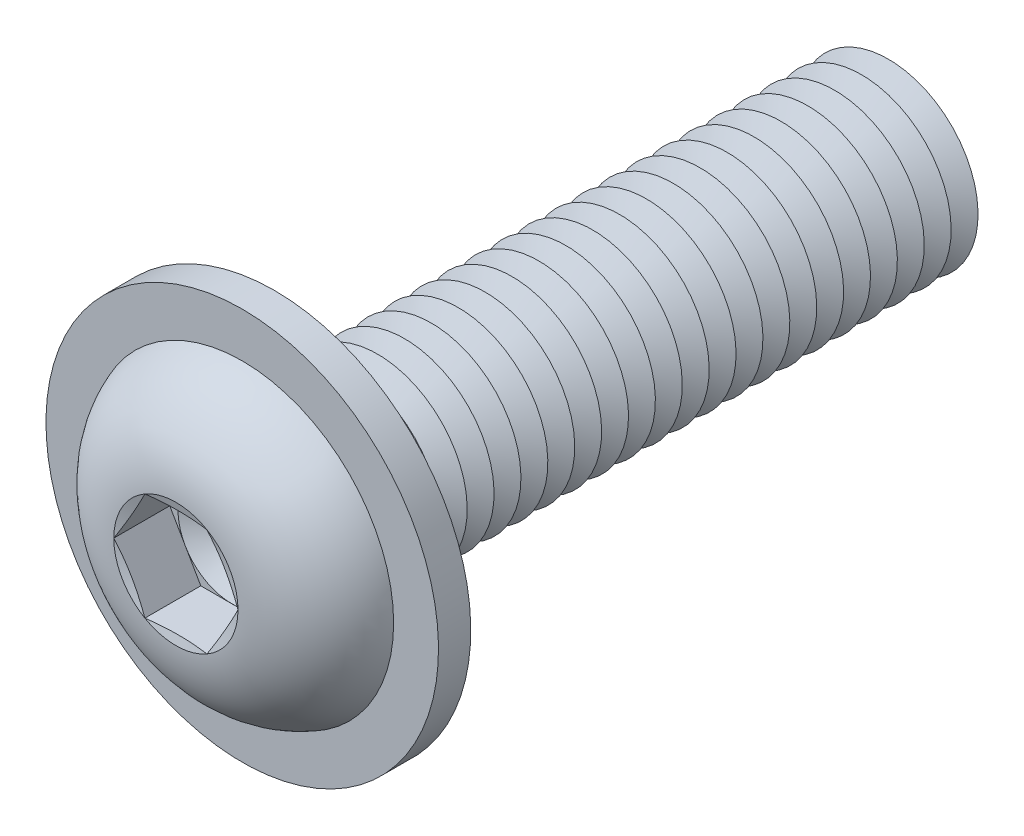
ISO-10303-21;
HEADER;
FILE_DESCRIPTION(('STEP AP214'),'2;1');
FILE_NAME('part.step','',(''),(''),'','','');
FILE_SCHEMA(('AUTOMOTIVE_DESIGN { 1 0 10303 214 1 1 1 1 }'));
ENDSEC;
DATA;
#1=APPLICATION_CONTEXT('core data for automotive mechanical design processes');
#2=APPLICATION_PROTOCOL_DEFINITION('international standard','automotive_design',2000,#1);
#3=PRODUCT_CONTEXT('',#1,'mechanical');
#4=PRODUCT('Part','Part','',(#3));
#5=PRODUCT_RELATED_PRODUCT_CATEGORY('part','',(#4));
#6=PRODUCT_DEFINITION_FORMATION('','',#4);
#7=PRODUCT_DEFINITION_CONTEXT('part definition',#1,'design');
#8=PRODUCT_DEFINITION('design','',#6,#7);
#9=PRODUCT_DEFINITION_SHAPE('','',#8);
#10=(LENGTH_UNIT() NAMED_UNIT(*) SI_UNIT(.MILLI.,.METRE.));
#11=(NAMED_UNIT(*) PLANE_ANGLE_UNIT() SI_UNIT($,.RADIAN.));
#12=(NAMED_UNIT(*) SI_UNIT($,.STERADIAN.) SOLID_ANGLE_UNIT());
#13=UNCERTAINTY_MEASURE_WITH_UNIT(LENGTH_MEASURE(1.E-05),#10,'distance_accuracy_value','');
#14=(GEOMETRIC_REPRESENTATION_CONTEXT(3) GLOBAL_UNCERTAINTY_ASSIGNED_CONTEXT((#13)) GLOBAL_UNIT_ASSIGNED_CONTEXT((#10,
#11,#12)) REPRESENTATION_CONTEXT('',''));
#15=CARTESIAN_POINT('',(0.,0.,0.));
#16=DIRECTION('',(0.,0.,1.));
#17=DIRECTION('',(1.,0.,0.));
#18=AXIS2_PLACEMENT_3D('',#15,#16,#17);
#19=CARTESIAN_POINT('',(0.,0.,-29.75));
#20=DIRECTION('',(0.,0.,1.));
#21=DIRECTION('',(0.,-1.,0.));
#22=AXIS2_PLACEMENT_3D('',#19,#20,#21);
#23=CONICAL_SURFACE('',#22,4.99999999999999,1.0471975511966);
#24=CARTESIAN_POINT('',(0.,0.,-30.5));
#25=DIRECTION('',(0.,0.,1.));
#26=DIRECTION('',(0.,-1.,0.));
#27=AXIS2_PLACEMENT_3D('',#24,#25,#26);
#28=CIRCLE('',#27,3.70096189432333);
#29=CARTESIAN_POINT('',(0.,-3.70096189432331,-30.5));
#30=VERTEX_POINT('',#29);
#31=EDGE_CURVE('E377',#30,#30,#28,.T.);
#32=ORIENTED_EDGE('',*,*,#31,.T.);
#33=EDGE_LOOP('',(#32));
#34=FACE_BOUND('',#33,.T.);
#35=CARTESIAN_POINT('',(0.,0.,-29.75));
#36=DIRECTION('',(0.,0.,1.));
#37=DIRECTION('',(0.,-1.,0.));
#38=AXIS2_PLACEMENT_3D('',#35,#36,#37);
#39=CIRCLE('',#38,4.99999999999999);
#40=CARTESIAN_POINT('',(0.,-4.99999999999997,-29.75));
#41=VERTEX_POINT('',#40);
#42=EDGE_CURVE('E375',#41,#41,#39,.T.);
#43=ORIENTED_EDGE('',*,*,#42,.F.);
#44=EDGE_LOOP('',(#43));
#45=FACE_BOUND('',#44,.T.);
#46=ADVANCED_FACE('F39',(#34,#45),#23,.T.);
#47=CARTESIAN_POINT('',(0.,0.,-30.5));
#48=DIRECTION('',(0.,0.,-1.));
#49=DIRECTION('',(0.,1.,0.));
#50=AXIS2_PLACEMENT_3D('',#47,#48,#49);
#51=CONICAL_SURFACE('',#50,3.70096189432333,1.0471975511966);
#52=CARTESIAN_POINT('',(0.,0.,-31.25));
#53=DIRECTION('',(0.,0.,1.));
#54=DIRECTION('',(0.,-1.,0.));
#55=AXIS2_PLACEMENT_3D('',#52,#53,#54);
#56=CIRCLE('',#55,4.99999999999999);
#57=CARTESIAN_POINT('',(0.,-4.99999999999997,-31.25));
#58=VERTEX_POINT('',#57);
#59=EDGE_CURVE('E384',#58,#58,#56,.T.);
#60=ORIENTED_EDGE('',*,*,#59,.T.);
#61=EDGE_LOOP('',(#60));
#62=FACE_BOUND('',#61,.T.);
#63=ORIENTED_EDGE('',*,*,#31,.F.);
#64=EDGE_LOOP('',(#63));
#65=FACE_BOUND('',#64,.T.);
#66=ADVANCED_FACE('F416',(#62,#65),#51,.T.);
#67=CARTESIAN_POINT('',(0.,5.,-35.));
#68=DIRECTION('',(0.,0.,-1.));
#69=DIRECTION('',(0.,1.,0.));
#70=AXIS2_PLACEMENT_3D('',#67,#68,#69);
#71=PLANE('',#70);
#72=CARTESIAN_POINT('',(0.,0.,-35.));
#73=DIRECTION('',(0.,0.,1.));
#74=DIRECTION('',(0.,-1.,0.));
#75=AXIS2_PLACEMENT_3D('',#72,#73,#74);
#76=CIRCLE('',#75,3.70096189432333);
#77=CARTESIAN_POINT('',(0.,-3.70096189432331,-35.));
#78=VERTEX_POINT('',#77);
#79=EDGE_CURVE('E322',#78,#78,#76,.T.);
#80=ORIENTED_EDGE('',*,*,#79,.F.);
#81=EDGE_LOOP('',(#80));
#82=FACE_BOUND('',#81,.T.);
#83=ADVANCED_FACE('F414',(#82),#71,.T.);
#84=CARTESIAN_POINT('',(0.,0.,-34.25));
#85=DIRECTION('',(0.,0.,1.));
#86=DIRECTION('',(0.,-1.,0.));
#87=AXIS2_PLACEMENT_3D('',#84,#85,#86);
#88=CONICAL_SURFACE('',#87,4.99999999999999,1.0471975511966);
#89=ORIENTED_EDGE('',*,*,#79,.T.);
#90=EDGE_LOOP('',(#89));
#91=FACE_BOUND('',#90,.T.);
#92=CARTESIAN_POINT('',(0.,0.,-34.25));
#93=DIRECTION('',(0.,0.,1.));
#94=DIRECTION('',(0.,-1.,0.));
#95=AXIS2_PLACEMENT_3D('',#92,#93,#94);
#96=CIRCLE('',#95,4.99999999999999);
#97=CARTESIAN_POINT('',(0.,-4.99999999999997,-34.25));
#98=VERTEX_POINT('',#97);
#99=EDGE_CURVE('E403',#98,#98,#96,.T.);
#100=ORIENTED_EDGE('',*,*,#99,.F.);
#101=EDGE_LOOP('',(#100));
#102=FACE_BOUND('',#101,.T.);
#103=ADVANCED_FACE('F411',(#91,#102),#88,.T.);
#104=CARTESIAN_POINT('',(0.,0.,-33.5));
#105=DIRECTION('',(0.,0.,-1.));
#106=DIRECTION('',(0.,1.,0.));
#107=AXIS2_PLACEMENT_3D('',#104,#105,#106);
#108=CONICAL_SURFACE('',#107,3.70096189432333,1.0471975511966);
#109=ORIENTED_EDGE('',*,*,#99,.T.);
#110=EDGE_LOOP('',(#109));
#111=FACE_BOUND('',#110,.T.);
#112=CARTESIAN_POINT('',(0.,0.,-33.5));
#113=DIRECTION('',(0.,0.,1.));
#114=DIRECTION('',(0.,-1.,0.));
#115=AXIS2_PLACEMENT_3D('',#112,#113,#114);
#116=CIRCLE('',#115,3.70096189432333);
#117=CARTESIAN_POINT('',(0.,-3.70096189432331,-33.5));
#118=VERTEX_POINT('',#117);
#119=EDGE_CURVE('E327',#118,#118,#116,.T.);
#120=ORIENTED_EDGE('',*,*,#119,.F.);
#121=EDGE_LOOP('',(#120));
#122=FACE_BOUND('',#121,.T.);
#123=ADVANCED_FACE('F421',(#111,#122),#108,.T.);
#124=CARTESIAN_POINT('',(0.,0.,-32.75));
#125=DIRECTION('',(0.,0.,1.));
#126=DIRECTION('',(0.,-1.,0.));
#127=AXIS2_PLACEMENT_3D('',#124,#125,#126);
#128=CONICAL_SURFACE('',#127,4.99999999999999,1.0471975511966);
#129=ORIENTED_EDGE('',*,*,#119,.T.);
#130=EDGE_LOOP('',(#129));
#131=FACE_BOUND('',#130,.T.);
#132=CARTESIAN_POINT('',(0.,0.,-32.75));
#133=DIRECTION('',(0.,0.,1.));
#134=DIRECTION('',(0.,-1.,0.));
#135=AXIS2_PLACEMENT_3D('',#132,#133,#134);
#136=CIRCLE('',#135,4.99999999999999);
#137=CARTESIAN_POINT('',(0.,-4.99999999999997,-32.75));
#138=VERTEX_POINT('',#137);
#139=EDGE_CURVE('E367',#138,#138,#136,.T.);
#140=ORIENTED_EDGE('',*,*,#139,.F.);
#141=EDGE_LOOP('',(#140));
#142=FACE_BOUND('',#141,.T.);
#143=ADVANCED_FACE('F437',(#131,#142),#128,.T.);
#144=CARTESIAN_POINT('',(0.,0.,-32.));
#145=DIRECTION('',(0.,0.,-1.));
#146=DIRECTION('',(0.,1.,0.));
#147=AXIS2_PLACEMENT_3D('',#144,#145,#146);
#148=CONICAL_SURFACE('',#147,3.70096189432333,1.0471975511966);
#149=ORIENTED_EDGE('',*,*,#139,.T.);
#150=EDGE_LOOP('',(#149));
#151=FACE_BOUND('',#150,.T.);
#152=CARTESIAN_POINT('',(0.,0.,-32.));
#153=DIRECTION('',(0.,0.,1.));
#154=DIRECTION('',(0.,-1.,0.));
#155=AXIS2_PLACEMENT_3D('',#152,#153,#154);
#156=CIRCLE('',#155,3.70096189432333);
#157=CARTESIAN_POINT('',(0.,-3.70096189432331,-32.));
#158=VERTEX_POINT('',#157);
#159=EDGE_CURVE('E395',#158,#158,#156,.T.);
#160=ORIENTED_EDGE('',*,*,#159,.F.);
#161=EDGE_LOOP('',(#160));
#162=FACE_BOUND('',#161,.T.);
#163=ADVANCED_FACE('F433',(#151,#162),#148,.T.);
#164=CARTESIAN_POINT('',(0.,0.,-31.25));
#165=DIRECTION('',(0.,0.,1.));
#166=DIRECTION('',(0.,-1.,0.));
#167=AXIS2_PLACEMENT_3D('',#164,#165,#166);
#168=CONICAL_SURFACE('',#167,4.99999999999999,1.0471975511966);
#169=ORIENTED_EDGE('',*,*,#159,.T.);
#170=EDGE_LOOP('',(#169));
#171=FACE_BOUND('',#170,.T.);
#172=ORIENTED_EDGE('',*,*,#59,.F.);
#173=EDGE_LOOP('',(#172));
#174=FACE_BOUND('',#173,.T.);
#175=ADVANCED_FACE('F436',(#171,#174),#168,.T.);
#176=CARTESIAN_POINT('',(0.,0.,-28.25));
#177=DIRECTION('',(0.,0.,1.));
#178=DIRECTION('',(0.,-1.,0.));
#179=AXIS2_PLACEMENT_3D('',#176,#177,#178);
#180=CONICAL_SURFACE('',#179,4.99999999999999,1.0471975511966);
#181=CARTESIAN_POINT('',(0.,0.,-29.));
#182=DIRECTION('',(0.,0.,1.));
#183=DIRECTION('',(0.,-1.,0.));
#184=AXIS2_PLACEMENT_3D('',#181,#182,#183);
#185=CIRCLE('',#184,3.70096189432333);
#186=CARTESIAN_POINT('',(0.,-3.70096189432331,-29.));
#187=VERTEX_POINT('',#186);
#188=EDGE_CURVE('E378',#187,#187,#185,.T.);
#189=ORIENTED_EDGE('',*,*,#188,.T.);
#190=EDGE_LOOP('',(#189));
#191=FACE_BOUND('',#190,.T.);
#192=CARTESIAN_POINT('',(0.,0.,-28.25));
#193=DIRECTION('',(0.,0.,1.));
#194=DIRECTION('',(0.,-1.,0.));
#195=AXIS2_PLACEMENT_3D('',#192,#193,#194);
#196=CIRCLE('',#195,4.99999999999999);
#197=CARTESIAN_POINT('',(0.,-4.99999999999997,-28.25));
#198=VERTEX_POINT('',#197);
#199=EDGE_CURVE('E388',#198,#198,#196,.T.);
#200=ORIENTED_EDGE('',*,*,#199,.F.);
#201=EDGE_LOOP('',(#200));
#202=FACE_BOUND('',#201,.T.);
#203=ADVANCED_FACE('F441',(#191,#202),#180,.T.);
#204=CARTESIAN_POINT('',(0.,0.,-29.));
#205=DIRECTION('',(0.,0.,-1.));
#206=DIRECTION('',(0.,1.,0.));
#207=AXIS2_PLACEMENT_3D('',#204,#205,#206);
#208=CONICAL_SURFACE('',#207,3.70096189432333,1.0471975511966);
#209=ORIENTED_EDGE('',*,*,#42,.T.);
#210=EDGE_LOOP('',(#209));
#211=FACE_BOUND('',#210,.T.);
#212=ORIENTED_EDGE('',*,*,#188,.F.);
#213=EDGE_LOOP('',(#212));
#214=FACE_BOUND('',#213,.T.);
#215=ADVANCED_FACE('F473',(#211,#214),#208,.T.);
#216=CARTESIAN_POINT('',(0.,0.,-26.75));
#217=DIRECTION('',(0.,0.,1.));
#218=DIRECTION('',(0.,-1.,0.));
#219=AXIS2_PLACEMENT_3D('',#216,#217,#218);
#220=CONICAL_SURFACE('',#219,4.99999999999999,1.0471975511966);
#221=CARTESIAN_POINT('',(0.,0.,-27.5));
#222=DIRECTION('',(0.,0.,1.));
#223=DIRECTION('',(0.,-1.,0.));
#224=AXIS2_PLACEMENT_3D('',#221,#222,#223);
#225=CIRCLE('',#224,3.70096189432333);
#226=CARTESIAN_POINT('',(0.,-3.70096189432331,-27.5));
#227=VERTEX_POINT('',#226);
#228=EDGE_CURVE('E1171',#227,#227,#225,.T.);
#229=ORIENTED_EDGE('',*,*,#228,.T.);
#230=EDGE_LOOP('',(#229));
#231=FACE_BOUND('',#230,.T.);
#232=CARTESIAN_POINT('',(0.,0.,-26.75));
#233=DIRECTION('',(0.,0.,1.));
#234=DIRECTION('',(0.,-1.,0.));
#235=AXIS2_PLACEMENT_3D('',#232,#233,#234);
#236=CIRCLE('',#235,4.99999999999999);
#237=CARTESIAN_POINT('',(0.,-4.99999999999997,-26.75));
#238=VERTEX_POINT('',#237);
#239=EDGE_CURVE('E348',#238,#238,#236,.T.);
#240=ORIENTED_EDGE('',*,*,#239,.F.);
#241=EDGE_LOOP('',(#240));
#242=FACE_BOUND('',#241,.T.);
#243=ADVANCED_FACE('F479',(#231,#242),#220,.T.);
#244=CARTESIAN_POINT('',(0.,0.,-27.5));
#245=DIRECTION('',(0.,0.,-1.));
#246=DIRECTION('',(0.,1.,0.));
#247=AXIS2_PLACEMENT_3D('',#244,#245,#246);
#248=CONICAL_SURFACE('',#247,3.70096189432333,1.0471975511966);
#249=ORIENTED_EDGE('',*,*,#199,.T.);
#250=EDGE_LOOP('',(#249));
#251=FACE_BOUND('',#250,.T.);
#252=ORIENTED_EDGE('',*,*,#228,.F.);
#253=EDGE_LOOP('',(#252));
#254=FACE_BOUND('',#253,.T.);
#255=ADVANCED_FACE('F485',(#251,#254),#248,.T.);
#256=CARTESIAN_POINT('',(0.,0.,-25.25));
#257=DIRECTION('',(0.,0.,1.));
#258=DIRECTION('',(0.,-1.,0.));
#259=AXIS2_PLACEMENT_3D('',#256,#257,#258);
#260=CONICAL_SURFACE('',#259,4.99999999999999,1.0471975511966);
#261=CARTESIAN_POINT('',(0.,0.,-26.));
#262=DIRECTION('',(0.,0.,1.));
#263=DIRECTION('',(0.,-1.,0.));
#264=AXIS2_PLACEMENT_3D('',#261,#262,#263);
#265=CIRCLE('',#264,3.70096189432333);
#266=CARTESIAN_POINT('',(0.,-3.70096189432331,-26.));
#267=VERTEX_POINT('',#266);
#268=EDGE_CURVE('E346',#267,#267,#265,.T.);
#269=ORIENTED_EDGE('',*,*,#268,.T.);
#270=EDGE_LOOP('',(#269));
#271=FACE_BOUND('',#270,.T.);
#272=CARTESIAN_POINT('',(0.,0.,-25.25));
#273=DIRECTION('',(0.,0.,1.));
#274=DIRECTION('',(0.,-1.,0.));
#275=AXIS2_PLACEMENT_3D('',#272,#273,#274);
#276=CIRCLE('',#275,4.99999999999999);
#277=CARTESIAN_POINT('',(0.,-4.99999999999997,-25.25));
#278=VERTEX_POINT('',#277);
#279=EDGE_CURVE('E349',#278,#278,#276,.T.);
#280=ORIENTED_EDGE('',*,*,#279,.F.);
#281=EDGE_LOOP('',(#280));
#282=FACE_BOUND('',#281,.T.);
#283=ADVANCED_FACE('F492',(#271,#282),#260,.T.);
#284=CARTESIAN_POINT('',(0.,0.,-26.));
#285=DIRECTION('',(0.,0.,-1.));
#286=DIRECTION('',(0.,1.,0.));
#287=AXIS2_PLACEMENT_3D('',#284,#285,#286);
#288=CONICAL_SURFACE('',#287,3.70096189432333,1.0471975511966);
#289=ORIENTED_EDGE('',*,*,#239,.T.);
#290=EDGE_LOOP('',(#289));
#291=FACE_BOUND('',#290,.T.);
#292=ORIENTED_EDGE('',*,*,#268,.F.);
#293=EDGE_LOOP('',(#292));
#294=FACE_BOUND('',#293,.T.);
#295=ADVANCED_FACE('F499',(#291,#294),#288,.T.);
#296=CARTESIAN_POINT('',(0.,0.,-23.75));
#297=DIRECTION('',(0.,0.,1.));
#298=DIRECTION('',(0.,-1.,0.));
#299=AXIS2_PLACEMENT_3D('',#296,#297,#298);
#300=CONICAL_SURFACE('',#299,4.99999999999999,1.0471975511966);
#301=CARTESIAN_POINT('',(0.,0.,-24.5));
#302=DIRECTION('',(0.,0.,1.));
#303=DIRECTION('',(0.,-1.,0.));
#304=AXIS2_PLACEMENT_3D('',#301,#302,#303);
#305=CIRCLE('',#304,3.70096189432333);
#306=CARTESIAN_POINT('',(0.,-3.70096189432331,-24.5));
#307=VERTEX_POINT('',#306);
#308=EDGE_CURVE('E1181',#307,#307,#305,.T.);
#309=ORIENTED_EDGE('',*,*,#308,.T.);
#310=EDGE_LOOP('',(#309));
#311=FACE_BOUND('',#310,.T.);
#312=CARTESIAN_POINT('',(0.,0.,-23.75));
#313=DIRECTION('',(0.,0.,1.));
#314=DIRECTION('',(0.,-1.,0.));
#315=AXIS2_PLACEMENT_3D('',#312,#313,#314);
#316=CIRCLE('',#315,4.99999999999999);
#317=CARTESIAN_POINT('',(0.,-4.99999999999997,-23.75));
#318=VERTEX_POINT('',#317);
#319=EDGE_CURVE('E1184',#318,#318,#316,.T.);
#320=ORIENTED_EDGE('',*,*,#319,.F.);
#321=EDGE_LOOP('',(#320));
#322=FACE_BOUND('',#321,.T.);
#323=ADVANCED_FACE('F506',(#311,#322),#300,.T.);
#324=CARTESIAN_POINT('',(0.,0.,-24.5));
#325=DIRECTION('',(0.,0.,-1.));
#326=DIRECTION('',(0.,1.,0.));
#327=AXIS2_PLACEMENT_3D('',#324,#325,#326);
#328=CONICAL_SURFACE('',#327,3.70096189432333,1.0471975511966);
#329=ORIENTED_EDGE('',*,*,#279,.T.);
#330=EDGE_LOOP('',(#329));
#331=FACE_BOUND('',#330,.T.);
#332=ORIENTED_EDGE('',*,*,#308,.F.);
#333=EDGE_LOOP('',(#332));
#334=FACE_BOUND('',#333,.T.);
#335=ADVANCED_FACE('F513',(#331,#334),#328,.T.);
#336=CARTESIAN_POINT('',(0.,0.,-22.25));
#337=DIRECTION('',(0.,0.,1.));
#338=DIRECTION('',(0.,-1.,0.));
#339=AXIS2_PLACEMENT_3D('',#336,#337,#338);
#340=CONICAL_SURFACE('',#339,4.99999999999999,1.0471975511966);
#341=CARTESIAN_POINT('',(0.,0.,-23.));
#342=DIRECTION('',(0.,0.,1.));
#343=DIRECTION('',(0.,-1.,0.));
#344=AXIS2_PLACEMENT_3D('',#341,#342,#343);
#345=CIRCLE('',#344,3.70096189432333);
#346=CARTESIAN_POINT('',(0.,-3.70096189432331,-23.));
#347=VERTEX_POINT('',#346);
#348=EDGE_CURVE('E1248',#347,#347,#345,.T.);
#349=ORIENTED_EDGE('',*,*,#348,.T.);
#350=EDGE_LOOP('',(#349));
#351=FACE_BOUND('',#350,.T.);
#352=CARTESIAN_POINT('',(0.,0.,-22.25));
#353=DIRECTION('',(0.,0.,1.));
#354=DIRECTION('',(0.,-1.,0.));
#355=AXIS2_PLACEMENT_3D('',#352,#353,#354);
#356=CIRCLE('',#355,4.99999999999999);
#357=CARTESIAN_POINT('',(0.,-4.99999999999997,-22.25));
#358=VERTEX_POINT('',#357);
#359=EDGE_CURVE('E1244',#358,#358,#356,.T.);
#360=ORIENTED_EDGE('',*,*,#359,.F.);
#361=EDGE_LOOP('',(#360));
#362=FACE_BOUND('',#361,.T.);
#363=ADVANCED_FACE('F520',(#351,#362),#340,.T.);
#364=CARTESIAN_POINT('',(0.,0.,-23.));
#365=DIRECTION('',(0.,0.,-1.));
#366=DIRECTION('',(0.,1.,0.));
#367=AXIS2_PLACEMENT_3D('',#364,#365,#366);
#368=CONICAL_SURFACE('',#367,3.70096189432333,1.0471975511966);
#369=ORIENTED_EDGE('',*,*,#319,.T.);
#370=EDGE_LOOP('',(#369));
#371=FACE_BOUND('',#370,.T.);
#372=ORIENTED_EDGE('',*,*,#348,.F.);
#373=EDGE_LOOP('',(#372));
#374=FACE_BOUND('',#373,.T.);
#375=ADVANCED_FACE('F527',(#371,#374),#368,.T.);
#376=CARTESIAN_POINT('',(0.,0.,-20.75));
#377=DIRECTION('',(0.,0.,1.));
#378=DIRECTION('',(0.,-1.,0.));
#379=AXIS2_PLACEMENT_3D('',#376,#377,#378);
#380=CONICAL_SURFACE('',#379,4.99999999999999,1.0471975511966);
#381=CARTESIAN_POINT('',(0.,0.,-21.5));
#382=DIRECTION('',(0.,0.,1.));
#383=DIRECTION('',(0.,-1.,0.));
#384=AXIS2_PLACEMENT_3D('',#381,#382,#383);
#385=CIRCLE('',#384,3.70096189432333);
#386=CARTESIAN_POINT('',(0.,-3.70096189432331,-21.5));
#387=VERTEX_POINT('',#386);
#388=EDGE_CURVE('E1241',#387,#387,#385,.T.);
#389=ORIENTED_EDGE('',*,*,#388,.T.);
#390=EDGE_LOOP('',(#389));
#391=FACE_BOUND('',#390,.T.);
#392=CARTESIAN_POINT('',(0.,0.,-20.75));
#393=DIRECTION('',(0.,0.,1.));
#394=DIRECTION('',(0.,-1.,0.));
#395=AXIS2_PLACEMENT_3D('',#392,#393,#394);
#396=CIRCLE('',#395,4.99999999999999);
#397=CARTESIAN_POINT('',(0.,-4.99999999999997,-20.75));
#398=VERTEX_POINT('',#397);
#399=EDGE_CURVE('E1237',#398,#398,#396,.T.);
#400=ORIENTED_EDGE('',*,*,#399,.F.);
#401=EDGE_LOOP('',(#400));
#402=FACE_BOUND('',#401,.T.);
#403=ADVANCED_FACE('F534',(#391,#402),#380,.T.);
#404=CARTESIAN_POINT('',(0.,0.,-21.5));
#405=DIRECTION('',(0.,0.,-1.));
#406=DIRECTION('',(0.,1.,0.));
#407=AXIS2_PLACEMENT_3D('',#404,#405,#406);
#408=CONICAL_SURFACE('',#407,3.70096189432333,1.0471975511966);
#409=ORIENTED_EDGE('',*,*,#359,.T.);
#410=EDGE_LOOP('',(#409));
#411=FACE_BOUND('',#410,.T.);
#412=ORIENTED_EDGE('',*,*,#388,.F.);
#413=EDGE_LOOP('',(#412));
#414=FACE_BOUND('',#413,.T.);
#415=ADVANCED_FACE('F541',(#411,#414),#408,.T.);
#416=CARTESIAN_POINT('',(0.,0.,-19.25));
#417=DIRECTION('',(0.,0.,1.));
#418=DIRECTION('',(0.,-1.,0.));
#419=AXIS2_PLACEMENT_3D('',#416,#417,#418);
#420=CONICAL_SURFACE('',#419,4.99999999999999,1.0471975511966);
#421=CARTESIAN_POINT('',(0.,0.,-20.));
#422=DIRECTION('',(0.,0.,1.));
#423=DIRECTION('',(0.,-1.,0.));
#424=AXIS2_PLACEMENT_3D('',#421,#422,#423);
#425=CIRCLE('',#424,3.70096189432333);
#426=CARTESIAN_POINT('',(0.,-3.70096189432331,-20.));
#427=VERTEX_POINT('',#426);
#428=EDGE_CURVE('E343',#427,#427,#425,.T.);
#429=ORIENTED_EDGE('',*,*,#428,.T.);
#430=EDGE_LOOP('',(#429));
#431=FACE_BOUND('',#430,.T.);
#432=CARTESIAN_POINT('',(0.,0.,-19.25));
#433=DIRECTION('',(0.,0.,1.));
#434=DIRECTION('',(0.,-1.,0.));
#435=AXIS2_PLACEMENT_3D('',#432,#433,#434);
#436=CIRCLE('',#435,4.99999999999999);
#437=CARTESIAN_POINT('',(0.,-4.99999999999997,-19.25));
#438=VERTEX_POINT('',#437);
#439=EDGE_CURVE('E340',#438,#438,#436,.T.);
#440=ORIENTED_EDGE('',*,*,#439,.F.);
#441=EDGE_LOOP('',(#440));
#442=FACE_BOUND('',#441,.T.);
#443=ADVANCED_FACE('F548',(#431,#442),#420,.T.);
#444=CARTESIAN_POINT('',(0.,0.,-20.));
#445=DIRECTION('',(0.,0.,-1.));
#446=DIRECTION('',(0.,1.,0.));
#447=AXIS2_PLACEMENT_3D('',#444,#445,#446);
#448=CONICAL_SURFACE('',#447,3.70096189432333,1.0471975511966);
#449=ORIENTED_EDGE('',*,*,#399,.T.);
#450=EDGE_LOOP('',(#449));
#451=FACE_BOUND('',#450,.T.);
#452=ORIENTED_EDGE('',*,*,#428,.F.);
#453=EDGE_LOOP('',(#452));
#454=FACE_BOUND('',#453,.T.);
#455=ADVANCED_FACE('F555',(#451,#454),#448,.T.);
#456=CARTESIAN_POINT('',(0.,0.,-17.75));
#457=DIRECTION('',(0.,0.,1.));
#458=DIRECTION('',(0.,-1.,0.));
#459=AXIS2_PLACEMENT_3D('',#456,#457,#458);
#460=CONICAL_SURFACE('',#459,4.99999999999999,1.0471975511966);
#461=CARTESIAN_POINT('',(0.,0.,-18.5));
#462=DIRECTION('',(0.,0.,1.));
#463=DIRECTION('',(0.,-1.,0.));
#464=AXIS2_PLACEMENT_3D('',#461,#462,#463);
#465=CIRCLE('',#464,3.70096189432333);
#466=CARTESIAN_POINT('',(0.,-3.70096189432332,-18.5));
#467=VERTEX_POINT('',#466);
#468=EDGE_CURVE('E344',#467,#467,#465,.T.);
#469=ORIENTED_EDGE('',*,*,#468,.T.);
#470=EDGE_LOOP('',(#469));
#471=FACE_BOUND('',#470,.T.);
#472=CARTESIAN_POINT('',(0.,0.,-17.75));
#473=DIRECTION('',(0.,0.,1.));
#474=DIRECTION('',(0.,-1.,0.));
#475=AXIS2_PLACEMENT_3D('',#472,#473,#474);
#476=CIRCLE('',#475,4.99999999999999);
#477=CARTESIAN_POINT('',(0.,-4.99999999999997,-17.75));
#478=VERTEX_POINT('',#477);
#479=EDGE_CURVE('E1166',#478,#478,#476,.T.);
#480=ORIENTED_EDGE('',*,*,#479,.F.);
#481=EDGE_LOOP('',(#480));
#482=FACE_BOUND('',#481,.T.);
#483=ADVANCED_FACE('F562',(#471,#482),#460,.T.);
#484=CARTESIAN_POINT('',(0.,0.,-18.5));
#485=DIRECTION('',(0.,0.,-1.));
#486=DIRECTION('',(0.,1.,0.));
#487=AXIS2_PLACEMENT_3D('',#484,#485,#486);
#488=CONICAL_SURFACE('',#487,3.70096189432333,1.0471975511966);
#489=ORIENTED_EDGE('',*,*,#439,.T.);
#490=EDGE_LOOP('',(#489));
#491=FACE_BOUND('',#490,.T.);
#492=ORIENTED_EDGE('',*,*,#468,.F.);
#493=EDGE_LOOP('',(#492));
#494=FACE_BOUND('',#493,.T.);
#495=ADVANCED_FACE('F569',(#491,#494),#488,.T.);
#496=CARTESIAN_POINT('',(0.,0.,-16.25));
#497=DIRECTION('',(0.,0.,1.));
#498=DIRECTION('',(0.,-1.,0.));
#499=AXIS2_PLACEMENT_3D('',#496,#497,#498);
#500=CONICAL_SURFACE('',#499,4.99999999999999,1.0471975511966);
#501=CARTESIAN_POINT('',(0.,0.,-17.));
#502=DIRECTION('',(0.,0.,1.));
#503=DIRECTION('',(0.,-1.,0.));
#504=AXIS2_PLACEMENT_3D('',#501,#502,#503);
#505=CIRCLE('',#504,3.70096189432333);
#506=CARTESIAN_POINT('',(0.,-3.70096189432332,-17.));
#507=VERTEX_POINT('',#506);
#508=EDGE_CURVE('E1169',#507,#507,#505,.T.);
#509=ORIENTED_EDGE('',*,*,#508,.T.);
#510=EDGE_LOOP('',(#509));
#511=FACE_BOUND('',#510,.T.);
#512=CARTESIAN_POINT('',(0.,0.,-16.25));
#513=DIRECTION('',(0.,0.,1.));
#514=DIRECTION('',(0.,-1.,0.));
#515=AXIS2_PLACEMENT_3D('',#512,#513,#514);
#516=CIRCLE('',#515,4.99999999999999);
#517=CARTESIAN_POINT('',(0.,-4.99999999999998,-16.25));
#518=VERTEX_POINT('',#517);
#519=EDGE_CURVE('E1225',#518,#518,#516,.T.);
#520=ORIENTED_EDGE('',*,*,#519,.F.);
#521=EDGE_LOOP('',(#520));
#522=FACE_BOUND('',#521,.T.);
#523=ADVANCED_FACE('F576',(#511,#522),#500,.T.);
#524=CARTESIAN_POINT('',(0.,0.,-17.));
#525=DIRECTION('',(0.,0.,-1.));
#526=DIRECTION('',(0.,1.,0.));
#527=AXIS2_PLACEMENT_3D('',#524,#525,#526);
#528=CONICAL_SURFACE('',#527,3.70096189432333,1.0471975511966);
#529=ORIENTED_EDGE('',*,*,#479,.T.);
#530=EDGE_LOOP('',(#529));
#531=FACE_BOUND('',#530,.T.);
#532=ORIENTED_EDGE('',*,*,#508,.F.);
#533=EDGE_LOOP('',(#532));
#534=FACE_BOUND('',#533,.T.);
#535=ADVANCED_FACE('F583',(#531,#534),#528,.T.);
#536=CARTESIAN_POINT('',(0.,0.,-14.75));
#537=DIRECTION('',(0.,0.,1.));
#538=DIRECTION('',(0.,-1.,0.));
#539=AXIS2_PLACEMENT_3D('',#536,#537,#538);
#540=CONICAL_SURFACE('',#539,4.99999999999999,1.0471975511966);
#541=CARTESIAN_POINT('',(0.,0.,-15.5));
#542=DIRECTION('',(0.,0.,1.));
#543=DIRECTION('',(0.,-1.,0.));
#544=AXIS2_PLACEMENT_3D('',#541,#542,#543);
#545=CIRCLE('',#544,3.70096189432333);
#546=CARTESIAN_POINT('',(0.,-3.70096189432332,-15.5));
#547=VERTEX_POINT('',#546);
#548=EDGE_CURVE('E1221',#547,#547,#545,.T.);
#549=ORIENTED_EDGE('',*,*,#548,.T.);
#550=EDGE_LOOP('',(#549));
#551=FACE_BOUND('',#550,.T.);
#552=CARTESIAN_POINT('',(0.,0.,-14.75));
#553=DIRECTION('',(0.,0.,1.));
#554=DIRECTION('',(0.,-1.,0.));
#555=AXIS2_PLACEMENT_3D('',#552,#553,#554);
#556=CIRCLE('',#555,4.99999999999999);
#557=CARTESIAN_POINT('',(0.,-4.99999999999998,-14.75));
#558=VERTEX_POINT('',#557);
#559=EDGE_CURVE('E1164',#558,#558,#556,.T.);
#560=ORIENTED_EDGE('',*,*,#559,.F.);
#561=EDGE_LOOP('',(#560));
#562=FACE_BOUND('',#561,.T.);
#563=ADVANCED_FACE('F590',(#551,#562),#540,.T.);
#564=CARTESIAN_POINT('',(0.,0.,-15.5));
#565=DIRECTION('',(0.,0.,-1.));
#566=DIRECTION('',(0.,1.,0.));
#567=AXIS2_PLACEMENT_3D('',#564,#565,#566);
#568=CONICAL_SURFACE('',#567,3.70096189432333,1.0471975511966);
#569=ORIENTED_EDGE('',*,*,#519,.T.);
#570=EDGE_LOOP('',(#569));
#571=FACE_BOUND('',#570,.T.);
#572=ORIENTED_EDGE('',*,*,#548,.F.);
#573=EDGE_LOOP('',(#572));
#574=FACE_BOUND('',#573,.T.);
#575=ADVANCED_FACE('F597',(#571,#574),#568,.T.);
#576=CARTESIAN_POINT('',(0.,0.,-13.25));
#577=DIRECTION('',(0.,0.,1.));
#578=DIRECTION('',(0.,-1.,0.));
#579=AXIS2_PLACEMENT_3D('',#576,#577,#578);
#580=CONICAL_SURFACE('',#579,4.99999999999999,1.0471975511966);
#581=CARTESIAN_POINT('',(0.,0.,-14.));
#582=DIRECTION('',(0.,0.,1.));
#583=DIRECTION('',(0.,-1.,0.));
#584=AXIS2_PLACEMENT_3D('',#581,#582,#583);
#585=CIRCLE('',#584,3.70096189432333);
#586=CARTESIAN_POINT('',(0.,-3.70096189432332,-14.));
#587=VERTEX_POINT('',#586);
#588=EDGE_CURVE('E337',#587,#587,#585,.T.);
#589=ORIENTED_EDGE('',*,*,#588,.T.);
#590=EDGE_LOOP('',(#589));
#591=FACE_BOUND('',#590,.T.);
#592=CARTESIAN_POINT('',(0.,0.,-13.25));
#593=DIRECTION('',(0.,0.,1.));
#594=DIRECTION('',(0.,-1.,0.));
#595=AXIS2_PLACEMENT_3D('',#592,#593,#594);
#596=CIRCLE('',#595,4.99999999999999);
#597=CARTESIAN_POINT('',(0.,-4.99999999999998,-13.25));
#598=VERTEX_POINT('',#597);
#599=EDGE_CURVE('E334',#598,#598,#596,.T.);
#600=ORIENTED_EDGE('',*,*,#599,.F.);
#601=EDGE_LOOP('',(#600));
#602=FACE_BOUND('',#601,.T.);
#603=ADVANCED_FACE('F604',(#591,#602),#580,.T.);
#604=CARTESIAN_POINT('',(0.,0.,-14.));
#605=DIRECTION('',(0.,0.,-1.));
#606=DIRECTION('',(0.,1.,0.));
#607=AXIS2_PLACEMENT_3D('',#604,#605,#606);
#608=CONICAL_SURFACE('',#607,3.70096189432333,1.0471975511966);
#609=ORIENTED_EDGE('',*,*,#559,.T.);
#610=EDGE_LOOP('',(#609));
#611=FACE_BOUND('',#610,.T.);
#612=ORIENTED_EDGE('',*,*,#588,.F.);
#613=EDGE_LOOP('',(#612));
#614=FACE_BOUND('',#613,.T.);
#615=ADVANCED_FACE('F611',(#611,#614),#608,.T.);
#616=CARTESIAN_POINT('',(0.,0.,-11.75));
#617=DIRECTION('',(0.,0.,1.));
#618=DIRECTION('',(0.,-1.,0.));
#619=AXIS2_PLACEMENT_3D('',#616,#617,#618);
#620=CONICAL_SURFACE('',#619,4.99999999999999,1.0471975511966);
#621=CARTESIAN_POINT('',(0.,0.,-12.5));
#622=DIRECTION('',(0.,0.,1.));
#623=DIRECTION('',(0.,-1.,0.));
#624=AXIS2_PLACEMENT_3D('',#621,#622,#623);
#625=CIRCLE('',#624,3.70096189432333);
#626=CARTESIAN_POINT('',(0.,-3.70096189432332,-12.5));
#627=VERTEX_POINT('',#626);
#628=EDGE_CURVE('E338',#627,#627,#625,.T.);
#629=ORIENTED_EDGE('',*,*,#628,.T.);
#630=EDGE_LOOP('',(#629));
#631=FACE_BOUND('',#630,.T.);
#632=CARTESIAN_POINT('',(0.,0.,-11.75));
#633=DIRECTION('',(0.,0.,1.));
#634=DIRECTION('',(0.,-1.,0.));
#635=AXIS2_PLACEMENT_3D('',#632,#633,#634);
#636=CIRCLE('',#635,4.99999999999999);
#637=CARTESIAN_POINT('',(0.,-4.99999999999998,-11.75));
#638=VERTEX_POINT('',#637);
#639=EDGE_CURVE('E1179',#638,#638,#636,.T.);
#640=ORIENTED_EDGE('',*,*,#639,.F.);
#641=EDGE_LOOP('',(#640));
#642=FACE_BOUND('',#641,.T.);
#643=ADVANCED_FACE('F618',(#631,#642),#620,.T.);
#644=CARTESIAN_POINT('',(0.,0.,-12.5));
#645=DIRECTION('',(0.,0.,-1.));
#646=DIRECTION('',(0.,1.,0.));
#647=AXIS2_PLACEMENT_3D('',#644,#645,#646);
#648=CONICAL_SURFACE('',#647,3.70096189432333,1.0471975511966);
#649=ORIENTED_EDGE('',*,*,#599,.T.);
#650=EDGE_LOOP('',(#649));
#651=FACE_BOUND('',#650,.T.);
#652=ORIENTED_EDGE('',*,*,#628,.F.);
#653=EDGE_LOOP('',(#652));
#654=FACE_BOUND('',#653,.T.);
#655=ADVANCED_FACE('F625',(#651,#654),#648,.T.);
#656=CARTESIAN_POINT('',(0.,0.,-10.25));
#657=DIRECTION('',(0.,0.,1.));
#658=DIRECTION('',(0.,-1.,0.));
#659=AXIS2_PLACEMENT_3D('',#656,#657,#658);
#660=CONICAL_SURFACE('',#659,4.99999999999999,1.0471975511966);
#661=CARTESIAN_POINT('',(0.,0.,-11.));
#662=DIRECTION('',(0.,0.,1.));
#663=DIRECTION('',(0.,-1.,0.));
#664=AXIS2_PLACEMENT_3D('',#661,#662,#663);
#665=CIRCLE('',#664,3.70096189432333);
#666=CARTESIAN_POINT('',(0.,-3.70096189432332,-11.));
#667=VERTEX_POINT('',#666);
#668=EDGE_CURVE('E1211',#667,#667,#665,.T.);
#669=ORIENTED_EDGE('',*,*,#668,.T.);
#670=EDGE_LOOP('',(#669));
#671=FACE_BOUND('',#670,.T.);
#672=CARTESIAN_POINT('',(0.,0.,-10.25));
#673=DIRECTION('',(0.,0.,1.));
#674=DIRECTION('',(0.,-1.,0.));
#675=AXIS2_PLACEMENT_3D('',#672,#673,#674);
#676=CIRCLE('',#675,4.99999999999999);
#677=CARTESIAN_POINT('',(0.,-4.99999999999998,-10.25));
#678=VERTEX_POINT('',#677);
#679=EDGE_CURVE('E1201',#678,#678,#676,.T.);
#680=ORIENTED_EDGE('',*,*,#679,.F.);
#681=EDGE_LOOP('',(#680));
#682=FACE_BOUND('',#681,.T.);
#683=ADVANCED_FACE('F632',(#671,#682),#660,.T.);
#684=CARTESIAN_POINT('',(0.,0.,-11.));
#685=DIRECTION('',(0.,0.,-1.));
#686=DIRECTION('',(0.,1.,0.));
#687=AXIS2_PLACEMENT_3D('',#684,#685,#686);
#688=CONICAL_SURFACE('',#687,3.70096189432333,1.0471975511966);
#689=ORIENTED_EDGE('',*,*,#639,.T.);
#690=EDGE_LOOP('',(#689));
#691=FACE_BOUND('',#690,.T.);
#692=ORIENTED_EDGE('',*,*,#668,.F.);
#693=EDGE_LOOP('',(#692));
#694=FACE_BOUND('',#693,.T.);
#695=ADVANCED_FACE('F639',(#691,#694),#688,.T.);
#696=CARTESIAN_POINT('',(0.,0.,-8.74999999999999));
#697=DIRECTION('',(0.,0.,1.));
#698=DIRECTION('',(0.,-1.,0.));
#699=AXIS2_PLACEMENT_3D('',#696,#697,#698);
#700=CONICAL_SURFACE('',#699,4.99999999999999,1.0471975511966);
#701=CARTESIAN_POINT('',(0.,0.,-9.49999999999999));
#702=DIRECTION('',(0.,0.,1.));
#703=DIRECTION('',(0.,-1.,0.));
#704=AXIS2_PLACEMENT_3D('',#701,#702,#703);
#705=CIRCLE('',#704,3.70096189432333);
#706=CARTESIAN_POINT('',(0.,-3.70096189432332,-9.49999999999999));
#707=VERTEX_POINT('',#706);
#708=EDGE_CURVE('E1195',#707,#707,#705,.T.);
#709=ORIENTED_EDGE('',*,*,#708,.T.);
#710=EDGE_LOOP('',(#709));
#711=FACE_BOUND('',#710,.T.);
#712=CARTESIAN_POINT('',(0.,0.,-8.74999999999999));
#713=DIRECTION('',(0.,0.,1.));
#714=DIRECTION('',(0.,-1.,0.));
#715=AXIS2_PLACEMENT_3D('',#712,#713,#714);
#716=CIRCLE('',#715,4.99999999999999);
#717=CARTESIAN_POINT('',(0.,-4.99999999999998,-8.74999999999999));
#718=VERTEX_POINT('',#717);
#719=EDGE_CURVE('E1193',#718,#718,#716,.T.);
#720=ORIENTED_EDGE('',*,*,#719,.F.);
#721=EDGE_LOOP('',(#720));
#722=FACE_BOUND('',#721,.T.);
#723=ADVANCED_FACE('F646',(#711,#722),#700,.T.);
#724=CARTESIAN_POINT('',(0.,0.,-9.49999999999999));
#725=DIRECTION('',(0.,0.,-1.));
#726=DIRECTION('',(0.,1.,0.));
#727=AXIS2_PLACEMENT_3D('',#724,#725,#726);
#728=CONICAL_SURFACE('',#727,3.70096189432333,1.0471975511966);
#729=ORIENTED_EDGE('',*,*,#679,.T.);
#730=EDGE_LOOP('',(#729));
#731=FACE_BOUND('',#730,.T.);
#732=ORIENTED_EDGE('',*,*,#708,.F.);
#733=EDGE_LOOP('',(#732));
#734=FACE_BOUND('',#733,.T.);
#735=ADVANCED_FACE('F653',(#731,#734),#728,.T.);
#736=CARTESIAN_POINT('',(0.,0.,-7.24999999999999));
#737=DIRECTION('',(0.,0.,1.));
#738=DIRECTION('',(0.,-1.,0.));
#739=AXIS2_PLACEMENT_3D('',#736,#737,#738);
#740=CONICAL_SURFACE('',#739,4.99999999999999,1.0471975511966);
#741=CARTESIAN_POINT('',(0.,0.,-7.99999999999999));
#742=DIRECTION('',(0.,0.,1.));
#743=DIRECTION('',(0.,-1.,0.));
#744=AXIS2_PLACEMENT_3D('',#741,#742,#743);
#745=CIRCLE('',#744,3.70096189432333);
#746=CARTESIAN_POINT('',(0.,-3.70096189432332,-7.99999999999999));
#747=VERTEX_POINT('',#746);
#748=EDGE_CURVE('E1196',#747,#747,#745,.T.);
#749=ORIENTED_EDGE('',*,*,#748,.T.);
#750=EDGE_LOOP('',(#749));
#751=FACE_BOUND('',#750,.T.);
#752=CARTESIAN_POINT('',(0.,0.,-7.24999999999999));
#753=DIRECTION('',(0.,0.,1.));
#754=DIRECTION('',(0.,-1.,0.));
#755=AXIS2_PLACEMENT_3D('',#752,#753,#754);
#756=CIRCLE('',#755,4.99999999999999);
#757=CARTESIAN_POINT('',(0.,-4.99999999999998,-7.24999999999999));
#758=VERTEX_POINT('',#757);
#759=EDGE_CURVE('E1205',#758,#758,#756,.T.);
#760=ORIENTED_EDGE('',*,*,#759,.F.);
#761=EDGE_LOOP('',(#760));
#762=FACE_BOUND('',#761,.T.);
#763=ADVANCED_FACE('F660',(#751,#762),#740,.T.);
#764=CARTESIAN_POINT('',(0.,0.,-7.99999999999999));
#765=DIRECTION('',(0.,0.,-1.));
#766=DIRECTION('',(0.,1.,0.));
#767=AXIS2_PLACEMENT_3D('',#764,#765,#766);
#768=CONICAL_SURFACE('',#767,3.70096189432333,1.0471975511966);
#769=ORIENTED_EDGE('',*,*,#719,.T.);
#770=EDGE_LOOP('',(#769));
#771=FACE_BOUND('',#770,.T.);
#772=ORIENTED_EDGE('',*,*,#748,.F.);
#773=EDGE_LOOP('',(#772));
#774=FACE_BOUND('',#773,.T.);
#775=ADVANCED_FACE('F667',(#771,#774),#768,.T.);
#776=CARTESIAN_POINT('',(0.,0.,-5.74999999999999));
#777=DIRECTION('',(0.,0.,1.));
#778=DIRECTION('',(0.,-1.,0.));
#779=AXIS2_PLACEMENT_3D('',#776,#777,#778);
#780=CONICAL_SURFACE('',#779,4.99999999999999,1.0471975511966);
#781=CARTESIAN_POINT('',(0.,0.,-6.49999999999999));
#782=DIRECTION('',(0.,0.,1.));
#783=DIRECTION('',(0.,-1.,0.));
#784=AXIS2_PLACEMENT_3D('',#781,#782,#783);
#785=CIRCLE('',#784,3.70096189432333);
#786=CARTESIAN_POINT('',(0.,-3.70096189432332,-6.49999999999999));
#787=VERTEX_POINT('',#786);
#788=EDGE_CURVE('E1335',#787,#787,#785,.T.);
#789=ORIENTED_EDGE('',*,*,#788,.T.);
#790=EDGE_LOOP('',(#789));
#791=FACE_BOUND('',#790,.T.);
#792=CARTESIAN_POINT('',(0.,0.,-5.74999999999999));
#793=DIRECTION('',(0.,0.,1.));
#794=DIRECTION('',(0.,-1.,0.));
#795=AXIS2_PLACEMENT_3D('',#792,#793,#794);
#796=CIRCLE('',#795,4.99999999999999);
#797=CARTESIAN_POINT('',(0.,-4.99999999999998,-5.74999999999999));
#798=VERTEX_POINT('',#797);
#799=EDGE_CURVE('E1337',#798,#798,#796,.T.);
#800=ORIENTED_EDGE('',*,*,#799,.F.);
#801=EDGE_LOOP('',(#800));
#802=FACE_BOUND('',#801,.T.);
#803=ADVANCED_FACE('F674',(#791,#802),#780,.T.);
#804=CARTESIAN_POINT('',(0.,0.,-6.49999999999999));
#805=DIRECTION('',(0.,0.,-1.));
#806=DIRECTION('',(0.,1.,0.));
#807=AXIS2_PLACEMENT_3D('',#804,#805,#806);
#808=CONICAL_SURFACE('',#807,3.70096189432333,1.0471975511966);
#809=ORIENTED_EDGE('',*,*,#759,.T.);
#810=EDGE_LOOP('',(#809));
#811=FACE_BOUND('',#810,.T.);
#812=ORIENTED_EDGE('',*,*,#788,.F.);
#813=EDGE_LOOP('',(#812));
#814=FACE_BOUND('',#813,.T.);
#815=ADVANCED_FACE('F681',(#811,#814),#808,.T.);
#816=CARTESIAN_POINT('',(0.,0.,-4.24999999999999));
#817=DIRECTION('',(0.,0.,1.));
#818=DIRECTION('',(0.,-1.,0.));
#819=AXIS2_PLACEMENT_3D('',#816,#817,#818);
#820=CONICAL_SURFACE('',#819,4.99999999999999,1.0471975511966);
#821=CARTESIAN_POINT('',(0.,0.,-4.99999999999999));
#822=DIRECTION('',(0.,0.,1.));
#823=DIRECTION('',(0.,-1.,0.));
#824=AXIS2_PLACEMENT_3D('',#821,#822,#823);
#825=CIRCLE('',#824,3.70096189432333);
#826=CARTESIAN_POINT('',(0.,-3.70096189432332,-4.99999999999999));
#827=VERTEX_POINT('',#826);
#828=EDGE_CURVE('E1160',#827,#827,#825,.T.);
#829=ORIENTED_EDGE('',*,*,#828,.T.);
#830=EDGE_LOOP('',(#829));
#831=FACE_BOUND('',#830,.T.);
#832=CARTESIAN_POINT('',(0.,0.,-4.24999999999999));
#833=DIRECTION('',(0.,0.,1.));
#834=DIRECTION('',(0.,-1.,0.));
#835=AXIS2_PLACEMENT_3D('',#832,#833,#834);
#836=CIRCLE('',#835,4.99999999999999);
#837=CARTESIAN_POINT('',(0.,-4.99999999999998,-4.24999999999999));
#838=VERTEX_POINT('',#837);
#839=EDGE_CURVE('E1157',#838,#838,#836,.T.);
#840=ORIENTED_EDGE('',*,*,#839,.F.);
#841=EDGE_LOOP('',(#840));
#842=FACE_BOUND('',#841,.T.);
#843=ADVANCED_FACE('F688',(#831,#842),#820,.T.);
#844=CARTESIAN_POINT('',(0.,0.,-4.99999999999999));
#845=DIRECTION('',(0.,0.,-1.));
#846=DIRECTION('',(0.,1.,0.));
#847=AXIS2_PLACEMENT_3D('',#844,#845,#846);
#848=CONICAL_SURFACE('',#847,3.70096189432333,1.0471975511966);
#849=ORIENTED_EDGE('',*,*,#799,.T.);
#850=EDGE_LOOP('',(#849));
#851=FACE_BOUND('',#850,.T.);
#852=ORIENTED_EDGE('',*,*,#828,.F.);
#853=EDGE_LOOP('',(#852));
#854=FACE_BOUND('',#853,.T.);
#855=ADVANCED_FACE('F695',(#851,#854),#848,.T.);
#856=CARTESIAN_POINT('',(0.,0.,-2.74999999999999));
#857=DIRECTION('',(0.,0.,1.));
#858=DIRECTION('',(0.,-1.,0.));
#859=AXIS2_PLACEMENT_3D('',#856,#857,#858);
#860=CONICAL_SURFACE('',#859,4.99999999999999,1.0471975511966);
#861=CARTESIAN_POINT('',(0.,0.,-3.49999999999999));
#862=DIRECTION('',(0.,0.,1.));
#863=DIRECTION('',(0.,-1.,0.));
#864=AXIS2_PLACEMENT_3D('',#861,#862,#863);
#865=CIRCLE('',#864,3.70096189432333);
#866=CARTESIAN_POINT('',(0.,-3.70096189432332,-3.49999999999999));
#867=VERTEX_POINT('',#866);
#868=EDGE_CURVE('E372',#867,#867,#865,.T.);
#869=ORIENTED_EDGE('',*,*,#868,.T.);
#870=EDGE_LOOP('',(#869));
#871=FACE_BOUND('',#870,.T.);
#872=CARTESIAN_POINT('',(0.,0.,-2.74999999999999));
#873=DIRECTION('',(0.,0.,1.));
#874=DIRECTION('',(0.,-1.,0.));
#875=AXIS2_PLACEMENT_3D('',#872,#873,#874);
#876=CIRCLE('',#875,4.99999999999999);
#877=CARTESIAN_POINT('',(0.,-4.99999999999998,-2.74999999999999));
#878=VERTEX_POINT('',#877);
#879=EDGE_CURVE('E373',#878,#878,#876,.T.);
#880=ORIENTED_EDGE('',*,*,#879,.F.);
#881=EDGE_LOOP('',(#880));
#882=FACE_BOUND('',#881,.T.);
#883=ADVANCED_FACE('F702',(#871,#882),#860,.T.);
#884=CARTESIAN_POINT('',(0.,0.,-3.49999999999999));
#885=DIRECTION('',(0.,0.,-1.));
#886=DIRECTION('',(0.,1.,0.));
#887=AXIS2_PLACEMENT_3D('',#884,#885,#886);
#888=CONICAL_SURFACE('',#887,3.70096189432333,1.0471975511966);
#889=ORIENTED_EDGE('',*,*,#839,.T.);
#890=EDGE_LOOP('',(#889));
#891=FACE_BOUND('',#890,.T.);
#892=ORIENTED_EDGE('',*,*,#868,.F.);
#893=EDGE_LOOP('',(#892));
#894=FACE_BOUND('',#893,.T.);
#895=ADVANCED_FACE('F709',(#891,#894),#888,.T.);
#896=CARTESIAN_POINT('',(0.,0.,-1.24999999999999));
#897=DIRECTION('',(0.,0.,1.));
#898=DIRECTION('',(0.,-1.,0.));
#899=AXIS2_PLACEMENT_3D('',#896,#897,#898);
#900=CONICAL_SURFACE('',#899,4.99999999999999,1.0471975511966);
#901=CARTESIAN_POINT('',(0.,0.,-1.99999999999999));
#902=DIRECTION('',(0.,0.,1.));
#903=DIRECTION('',(0.,-1.,0.));
#904=AXIS2_PLACEMENT_3D('',#901,#902,#903);
#905=CIRCLE('',#904,3.70096189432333);
#906=CARTESIAN_POINT('',(0.,-3.70096189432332,-1.99999999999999));
#907=VERTEX_POINT('',#906);
#908=EDGE_CURVE('E227',#907,#907,#905,.T.);
#909=ORIENTED_EDGE('',*,*,#908,.T.);
#910=EDGE_LOOP('',(#909));
#911=FACE_BOUND('',#910,.T.);
#912=CARTESIAN_POINT('',(0.,0.,-1.24999999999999));
#913=DIRECTION('',(0.,0.,1.));
#914=DIRECTION('',(0.,-1.,0.));
#915=AXIS2_PLACEMENT_3D('',#912,#913,#914);
#916=CIRCLE('',#915,4.99999999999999);
#917=CARTESIAN_POINT('',(0.,-4.99999999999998,-1.24999999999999));
#918=VERTEX_POINT('',#917);
#919=EDGE_CURVE('E369',#918,#918,#916,.T.);
#920=ORIENTED_EDGE('',*,*,#919,.F.);
#921=EDGE_LOOP('',(#920));
#922=FACE_BOUND('',#921,.T.);
#923=ADVANCED_FACE('F716',(#911,#922),#900,.T.);
#924=CARTESIAN_POINT('',(0.,0.,-1.99999999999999));
#925=DIRECTION('',(0.,0.,-1.));
#926=DIRECTION('',(0.,1.,0.));
#927=AXIS2_PLACEMENT_3D('',#924,#925,#926);
#928=CONICAL_SURFACE('',#927,3.70096189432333,1.0471975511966);
#929=ORIENTED_EDGE('',*,*,#879,.T.);
#930=EDGE_LOOP('',(#929));
#931=FACE_BOUND('',#930,.T.);
#932=ORIENTED_EDGE('',*,*,#908,.F.);
#933=EDGE_LOOP('',(#932));
#934=FACE_BOUND('',#933,.T.);
#935=ADVANCED_FACE('F211',(#931,#934),#928,.T.);
#936=CARTESIAN_POINT('',(0.,5.,0.));
#937=DIRECTION('',(0.,0.,-1.));
#938=DIRECTION('',(0.,1.,0.));
#939=AXIS2_PLACEMENT_3D('',#936,#937,#938);
#940=PLANE('',#939);
#941=CARTESIAN_POINT('',(0.,0.,0.));
#942=DIRECTION('',(0.,0.,-1.));
#943=DIRECTION('',(0.,1.,0.));
#944=AXIS2_PLACEMENT_3D('',#941,#942,#943);
#945=CIRCLE('',#944,5.74999999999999);
#946=CARTESIAN_POINT('',(0.,5.74999999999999,0.));
#947=VERTEX_POINT('',#946);
#948=EDGE_CURVE('E281',#947,#947,#945,.F.);
#949=ORIENTED_EDGE('',*,*,#948,.T.);
#950=EDGE_LOOP('',(#949));
#951=FACE_BOUND('',#950,.T.);
#952=CARTESIAN_POINT('',(0.,0.,0.));
#953=DIRECTION('',(0.,0.,-1.));
#954=DIRECTION('',(0.,1.,0.));
#955=AXIS2_PLACEMENT_3D('',#952,#953,#954);
#956=CIRCLE('',#955,10.95);
#957=CARTESIAN_POINT('',(0.,10.95,0.));
#958=VERTEX_POINT('',#957);
#959=EDGE_CURVE('E332',#958,#958,#956,.T.);
#960=ORIENTED_EDGE('',*,*,#959,.T.);
#961=EDGE_LOOP('',(#960));
#962=FACE_BOUND('',#961,.T.);
#963=ADVANCED_FACE('F728',(#951,#962),#940,.T.);
#964=CARTESIAN_POINT('',(0.,0.,-0.750000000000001));
#965=DIRECTION('',(0.,0.,-1.));
#966=DIRECTION('',(0.,1.,0.));
#967=AXIS2_PLACEMENT_3D('',#964,#965,#966);
#968=TOROIDAL_SURFACE('',#967,5.74999999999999,0.75);
#969=ORIENTED_EDGE('',*,*,#948,.F.);
#970=EDGE_LOOP('',(#969));
#971=FACE_BOUND('',#970,.T.);
#972=CARTESIAN_POINT('',(0.,0.,-0.750000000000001));
#973=DIRECTION('',(0.,0.,-1.));
#974=DIRECTION('',(0.,1.,0.));
#975=AXIS2_PLACEMENT_3D('',#972,#973,#974);
#976=CIRCLE('',#975,4.99999999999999);
#977=CARTESIAN_POINT('',(0.,4.99999999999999,-0.749999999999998));
#978=VERTEX_POINT('',#977);
#979=EDGE_CURVE('E287',#978,#978,#976,.T.);
#980=ORIENTED_EDGE('',*,*,#979,.F.);
#981=EDGE_LOOP('',(#980));
#982=FACE_BOUND('',#981,.T.);
#983=ADVANCED_FACE('F41',(#971,#982),#968,.F.);
#984=CARTESIAN_POINT('',(0.,0.,-35.));
#985=DIRECTION('',(0.,0.,-1.));
#986=DIRECTION('',(0.,1.,0.));
#987=AXIS2_PLACEMENT_3D('',#984,#985,#986);
#988=CYLINDRICAL_SURFACE('',#987,4.99999999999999);
#989=ORIENTED_EDGE('',*,*,#979,.T.);
#990=EDGE_LOOP('',(#989));
#991=FACE_BOUND('',#990,.T.);
#992=ORIENTED_EDGE('',*,*,#919,.T.);
#993=EDGE_LOOP('',(#992));
#994=FACE_BOUND('',#993,.T.);
#995=ADVANCED_FACE('F739',(#991,#994),#988,.T.);
#996=CARTESIAN_POINT('',(0.,0.,1.8));
#997=DIRECTION('',(0.,0.,-1.));
#998=DIRECTION('',(0.,1.,0.));
#999=AXIS2_PLACEMENT_3D('',#996,#997,#998);
#1000=CYLINDRICAL_SURFACE('',#999,10.95);
#1001=CARTESIAN_POINT('',(0.,0.,1.8));
#1002=DIRECTION('',(0.,0.,-1.));
#1003=DIRECTION('',(0.,1.,0.));
#1004=AXIS2_PLACEMENT_3D('',#1001,#1002,#1003);
#1005=CIRCLE('',#1004,10.95);
#1006=CARTESIAN_POINT('',(0.,10.95,1.8));
#1007=VERTEX_POINT('',#1006);
#1008=EDGE_CURVE('E329',#1007,#1007,#1005,.T.);
#1009=ORIENTED_EDGE('',*,*,#1008,.T.);
#1010=EDGE_LOOP('',(#1009));
#1011=FACE_BOUND('',#1010,.T.);
#1012=ORIENTED_EDGE('',*,*,#959,.F.);
#1013=EDGE_LOOP('',(#1012));
#1014=FACE_BOUND('',#1013,.T.);
#1015=ADVANCED_FACE('F745',(#1011,#1014),#1000,.T.);
#1016=CARTESIAN_POINT('',(0.,0.,1.8));
#1017=DIRECTION('',(0.,0.,-1.));
#1018=DIRECTION('',(0.,1.,0.));
#1019=AXIS2_PLACEMENT_3D('',#1016,#1017,#1018);
#1020=PLANE('',#1019);
#1021=CARTESIAN_POINT('',(0.,0.,1.8));
#1022=DIRECTION('',(0.,0.,-1.));
#1023=DIRECTION('',(0.,1.,0.));
#1024=AXIS2_PLACEMENT_3D('',#1021,#1022,#1023);
#1025=CIRCLE('',#1024,8.4473670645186);
#1026=CARTESIAN_POINT('',(0.,8.4473670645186,1.8));
#1027=VERTEX_POINT('',#1026);
#1028=EDGE_CURVE('E43',#1027,#1027,#1025,.F.);
#1029=ORIENTED_EDGE('',*,*,#1028,.F.);
#1030=EDGE_LOOP('',(#1029));
#1031=FACE_BOUND('',#1030,.T.);
#1032=ORIENTED_EDGE('',*,*,#1008,.F.);
#1033=EDGE_LOOP('',(#1032));
#1034=FACE_BOUND('',#1033,.T.);
#1035=ADVANCED_FACE('F117',(#1031,#1034),#1020,.F.);
#1036=CARTESIAN_POINT('',(0.,0.,2.38));
#1037=DIRECTION('',(0.,0.,1.));
#1038=DIRECTION('',(1.,0.,0.));
#1039=AXIS2_PLACEMENT_3D('',#1036,#1037,#1038);
#1040=CONICAL_SURFACE('',#1039,2.99999860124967,1.0471975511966);
#1041=CARTESIAN_POINT('',(0.,0.,0.647950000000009));
#1042=VERTEX_POINT('',#1041);
#1043=VERTEX_LOOP('',#1042);
#1044=FACE_BOUND('',#1043,.T.);
#1045=CARTESIAN_POINT('',(0.,0.,2.38));
#1046=DIRECTION('',(0.,0.,1.));
#1047=DIRECTION('',(1.,0.,0.));
#1048=AXIS2_PLACEMENT_3D('',#1045,#1046,#1047);
#1049=CIRCLE('',#1048,2.99999860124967);
#1050=CARTESIAN_POINT('',(2.598075,1.49999930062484,2.38));
#1051=VERTEX_POINT('',#1050);
#1052=CARTESIAN_POINT('',(0.,2.99999860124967,2.38));
#1053=VERTEX_POINT('',#1052);
#1054=EDGE_CURVE('E120',#1051,#1053,#1049,.T.);
#1055=ORIENTED_EDGE('',*,*,#1054,.T.);
#1056=CARTESIAN_POINT('',(0.,0.,2.38));
#1057=DIRECTION('',(0.,0.,1.));
#1058=DIRECTION('',(1.,0.,0.));
#1059=AXIS2_PLACEMENT_3D('',#1056,#1057,#1058);
#1060=CIRCLE('',#1059,2.99999860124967);
#1061=CARTESIAN_POINT('',(-2.598075,1.49999930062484,2.38));
#1062=VERTEX_POINT('',#1061);
#1063=EDGE_CURVE('E11',#1053,#1062,#1060,.T.);
#1064=ORIENTED_EDGE('',*,*,#1063,.T.);
#1065=CARTESIAN_POINT('',(-2.598075,-1.49999930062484,2.38));
#1066=VERTEX_POINT('',#1065);
#1067=EDGE_CURVE('E49',#1062,#1066,#1060,.T.);
#1068=ORIENTED_EDGE('',*,*,#1067,.T.);
#1069=CARTESIAN_POINT('',(0.,-2.99999860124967,2.38));
#1070=VERTEX_POINT('',#1069);
#1071=EDGE_CURVE('E285',#1066,#1070,#1060,.T.);
#1072=ORIENTED_EDGE('',*,*,#1071,.T.);
#1073=CARTESIAN_POINT('',(2.598075,-1.49999930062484,2.38));
#1074=VERTEX_POINT('',#1073);
#1075=EDGE_CURVE('E57',#1070,#1074,#1060,.T.);
#1076=ORIENTED_EDGE('',*,*,#1075,.T.);
#1077=EDGE_CURVE('E50',#1074,#1051,#1060,.T.);
#1078=ORIENTED_EDGE('',*,*,#1077,.T.);
#1079=EDGE_LOOP('',(#1055,#1064,#1068,#1072,#1076,#1078));
#1080=FACE_BOUND('',#1079,.T.);
#1081=ADVANCED_FACE('F114',(#1044,#1080),#1040,.F.);
#1082=CARTESIAN_POINT('',(0.,0.,2.38));
#1083=DIRECTION('',(0.,0.,1.));
#1084=DIRECTION('',(1.,0.,0.));
#1085=AXIS2_PLACEMENT_3D('',#1082,#1083,#1084);
#1086=PLANE('',#1085);
#1087=ORIENTED_EDGE('',*,*,#1063,.F.);
#1088=DIRECTION('',(-1.,0.,0.));
#1089=VECTOR('',#1088,1.);
#1090=CARTESIAN_POINT('',(1.73205,2.99999860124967,2.38));
#1091=LINE('',#1090,#1089);
#1092=CARTESIAN_POINT('',(-1.73205,2.99999860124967,2.38));
#1093=VERTEX_POINT('',#1092);
#1094=EDGE_CURVE('E132',#1053,#1093,#1091,.T.);
#1095=ORIENTED_EDGE('',*,*,#1094,.T.);
#1096=DIRECTION('',(-0.5,-0.866025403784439,0.));
#1097=VECTOR('',#1096,1.);
#1098=CARTESIAN_POINT('',(-1.73205,2.99999860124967,2.38));
#1099=LINE('',#1098,#1097);
#1100=EDGE_CURVE('E135',#1093,#1062,#1099,.T.);
#1101=ORIENTED_EDGE('',*,*,#1100,.T.);
#1102=EDGE_LOOP('',(#1087,#1095,#1101));
#1103=FACE_BOUND('',#1102,.T.);
#1104=ADVANCED_FACE('F116',(#1103),#1086,.T.);
#1105=ORIENTED_EDGE('',*,*,#1067,.F.);
#1106=CARTESIAN_POINT('',(-3.4641,0.,2.38));
#1107=VERTEX_POINT('',#1106);
#1108=EDGE_CURVE('E145',#1062,#1107,#1099,.T.);
#1109=ORIENTED_EDGE('',*,*,#1108,.T.);
#1110=DIRECTION('',(0.5,-0.866025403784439,0.));
#1111=VECTOR('',#1110,1.);
#1112=CARTESIAN_POINT('',(-3.4641,0.,2.38));
#1113=LINE('',#1112,#1111);
#1114=EDGE_CURVE('E154',#1107,#1066,#1113,.T.);
#1115=ORIENTED_EDGE('',*,*,#1114,.T.);
#1116=EDGE_LOOP('',(#1105,#1109,#1115));
#1117=FACE_BOUND('',#1116,.T.);
#1118=ADVANCED_FACE('F766',(#1117),#1086,.T.);
#1119=ORIENTED_EDGE('',*,*,#1071,.F.);
#1120=CARTESIAN_POINT('',(-1.73205,-2.99999860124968,2.38));
#1121=VERTEX_POINT('',#1120);
#1122=EDGE_CURVE('E153',#1066,#1121,#1113,.T.);
#1123=ORIENTED_EDGE('',*,*,#1122,.T.);
#1124=DIRECTION('',(1.,0.,0.));
#1125=VECTOR('',#1124,1.);
#1126=CARTESIAN_POINT('',(-1.73205,-2.99999860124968,2.38));
#1127=LINE('',#1126,#1125);
#1128=EDGE_CURVE('E159',#1121,#1070,#1127,.T.);
#1129=ORIENTED_EDGE('',*,*,#1128,.T.);
#1130=EDGE_LOOP('',(#1119,#1123,#1129));
#1131=FACE_BOUND('',#1130,.T.);
#1132=ADVANCED_FACE('F355',(#1131),#1086,.T.);
#1133=ORIENTED_EDGE('',*,*,#1075,.F.);
#1134=CARTESIAN_POINT('',(1.73205,-2.99999860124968,2.38));
#1135=VERTEX_POINT('',#1134);
#1136=EDGE_CURVE('E158',#1070,#1135,#1127,.T.);
#1137=ORIENTED_EDGE('',*,*,#1136,.T.);
#1138=DIRECTION('',(0.5,0.866025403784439,0.));
#1139=VECTOR('',#1138,1.);
#1140=CARTESIAN_POINT('',(1.73205,-2.99999860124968,2.38));
#1141=LINE('',#1140,#1139);
#1142=EDGE_CURVE('E164',#1135,#1074,#1141,.T.);
#1143=ORIENTED_EDGE('',*,*,#1142,.T.);
#1144=EDGE_LOOP('',(#1133,#1137,#1143));
#1145=FACE_BOUND('',#1144,.T.);
#1146=ADVANCED_FACE('F776',(#1145),#1086,.T.);
#1147=ORIENTED_EDGE('',*,*,#1077,.F.);
#1148=CARTESIAN_POINT('',(3.4641,0.,2.38));
#1149=VERTEX_POINT('',#1148);
#1150=EDGE_CURVE('E163',#1074,#1149,#1141,.T.);
#1151=ORIENTED_EDGE('',*,*,#1150,.T.);
#1152=DIRECTION('',(-0.5,0.866025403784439,0.));
#1153=VECTOR('',#1152,1.);
#1154=CARTESIAN_POINT('',(3.4641,0.,2.38));
#1155=LINE('',#1154,#1153);
#1156=EDGE_CURVE('E141',#1149,#1051,#1155,.T.);
#1157=ORIENTED_EDGE('',*,*,#1156,.T.);
#1158=EDGE_LOOP('',(#1147,#1151,#1157));
#1159=FACE_BOUND('',#1158,.T.);
#1160=ADVANCED_FACE('F781',(#1159),#1086,.T.);
#1161=ORIENTED_EDGE('',*,*,#1054,.F.);
#1162=CARTESIAN_POINT('',(1.73205,2.99999860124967,2.38));
#1163=VERTEX_POINT('',#1162);
#1164=EDGE_CURVE('E127',#1051,#1163,#1155,.T.);
#1165=ORIENTED_EDGE('',*,*,#1164,.T.);
#1166=EDGE_CURVE('E137',#1163,#1053,#1091,.T.);
#1167=ORIENTED_EDGE('',*,*,#1166,.T.);
#1168=EDGE_LOOP('',(#1161,#1165,#1167));
#1169=FACE_BOUND('',#1168,.T.);
#1170=ADVANCED_FACE('F143',(#1169),#1086,.T.);
#1171=CARTESIAN_POINT('',(1.73205,2.99999860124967,2.38));
#1172=DIRECTION('',(0.,1.,0.));
#1173=DIRECTION('',(-1.,0.,0.));
#1174=AXIS2_PLACEMENT_3D('',#1171,#1172,#1173);
#1175=PLANE('',#1174);
#1176=CARTESIAN_POINT('',(5.2273006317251,2.99999860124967,6.18672552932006));
#1177=CARTESIAN_POINT('',(5.10075887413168,2.99999860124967,6.15732018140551));
#1178=CARTESIAN_POINT('',(4.97415993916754,2.99999860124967,6.12816064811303));
#1179=CARTESIAN_POINT('',(4.72082394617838,2.99999860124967,6.07043857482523));
#1180=CARTESIAN_POINT('',(4.59408688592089,2.99999860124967,6.04187604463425));
#1181=CARTESIAN_POINT('',(4.21358997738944,2.99999860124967,5.95723252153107));
#1182=CARTESIAN_POINT('',(3.95959339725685,2.99999860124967,5.90220706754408));
#1183=CARTESIAN_POINT('',(3.44835573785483,2.99999860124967,5.79574115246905));
#1184=CARTESIAN_POINT('',(3.19110656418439,2.99999860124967,5.744339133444));
#1185=CARTESIAN_POINT('',(2.67540790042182,2.99999860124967,5.6477299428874));
#1186=CARTESIAN_POINT('',(2.41695830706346,2.99999860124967,5.60252331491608));
#1187=CARTESIAN_POINT('',(1.90555125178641,2.99999860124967,5.52251897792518));
#1188=CARTESIAN_POINT('',(1.65263426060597,2.99999860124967,5.48747285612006));
#1189=CARTESIAN_POINT('',(1.27220564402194,2.99999860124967,5.44439602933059));
#1190=CARTESIAN_POINT('',(1.1452320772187,2.99999860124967,5.43161987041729));
#1191=CARTESIAN_POINT('',(0.890973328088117,2.99999860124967,5.40972605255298));
#1192=CARTESIAN_POINT('',(0.763688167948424,2.99999860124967,5.40060814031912));
#1193=CARTESIAN_POINT('',(0.509442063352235,2.99999860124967,5.38647457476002));
#1194=CARTESIAN_POINT('',(0.382482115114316,2.99999860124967,5.38144125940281));
#1195=CARTESIAN_POINT('',(0.128463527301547,2.99999860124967,5.37566637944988));
#1196=CARTESIAN_POINT('',(0.00140488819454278,2.99999860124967,5.37492479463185));
#1197=CARTESIAN_POINT('',(-0.252672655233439,2.99999860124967,5.37777315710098));
#1198=CARTESIAN_POINT('',(-0.379691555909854,2.99999860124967,5.38136342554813));
#1199=CARTESIAN_POINT('',(-0.633540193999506,2.99999860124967,5.39268816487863));
#1200=CARTESIAN_POINT('',(-0.760369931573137,2.99999860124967,5.40042263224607));
#1201=CARTESIAN_POINT('',(-1.06836981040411,2.99999860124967,5.42382465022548));
#1202=CARTESIAN_POINT('',(-1.24938929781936,2.99999860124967,5.4414748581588));
#1203=CARTESIAN_POINT('',(-1.61066786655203,2.99999860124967,5.48312309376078));
#1204=CARTESIAN_POINT('',(-1.7909269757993,2.99999860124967,5.50712088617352));
#1205=CARTESIAN_POINT('',(-2.15127612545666,2.99999860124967,5.56013471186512));
#1206=CARTESIAN_POINT('',(-2.33136383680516,2.99999860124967,5.58916634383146));
#1207=CARTESIAN_POINT('',(-2.690892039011,2.99999860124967,5.65100028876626));
#1208=CARTESIAN_POINT('',(-2.87033249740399,2.99999860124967,5.68380278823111));
#1209=CARTESIAN_POINT('',(-3.23235399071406,2.99999860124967,5.75295369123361));
#1210=CARTESIAN_POINT('',(-3.4149236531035,2.99999860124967,5.78936117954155));
#1211=CARTESIAN_POINT('',(-3.77960351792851,2.99999860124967,5.86440648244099));
#1212=CARTESIAN_POINT('',(-3.96171371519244,2.99999860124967,5.903044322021));
#1213=CARTESIAN_POINT('',(-4.32457472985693,2.99999860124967,5.98179660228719));
#1214=CARTESIAN_POINT('',(-4.5053275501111,2.99999860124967,6.02190185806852));
#1215=CARTESIAN_POINT('',(-4.86652484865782,2.99999860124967,6.10342152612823));
#1216=CARTESIAN_POINT('',(-5.04696934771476,2.99999860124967,6.14483584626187));
#1217=CARTESIAN_POINT('',(-5.2273006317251,2.99999860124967,6.18672552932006));
#1218=B_SPLINE_CURVE_WITH_KNOTS('',3,(#1176,#1177,#1178,#1179,#1180,#1181,#1182,#1183,#1184,
#1185,#1186,#1187,#1188,#1189,#1190,#1191,#1192,#1193,#1194,#1195,#1196,#1197,#1198,#1199,#1200,
#1201,#1202,#1203,#1204,#1205,#1206,#1207,#1208,#1209,#1210,#1211,#1212,#1213,#1214,#1215,#1216,
#1217),.UNSPECIFIED.,.F.,.F.,(4,2,2,2,2,2,2,2,2,2,2,2,2,2,2,2,2,2,2,2,4),(0.,0.389739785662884,
0.779485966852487,1.5591292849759,2.34608117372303,3.13310206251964,3.8988410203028,
4.28164148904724,4.66441544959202,5.04552531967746,5.42663339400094,5.80776972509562,
6.18890573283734,6.73438998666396,7.27985402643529,7.8270395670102,8.37425218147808,
8.93272720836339,9.49120849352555,10.0466490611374,10.6020506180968),.UNSPECIFIED.);
#1219=CARTESIAN_POINT('',(1.73204999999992,2.99999860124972,5.5));
#1220=VERTEX_POINT('',#1219);
#1221=CARTESIAN_POINT('',(-1.73205,2.99999860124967,5.5));
#1222=VERTEX_POINT('',#1221);
#1223=EDGE_CURVE('E172',#1220,#1222,#1218,.T.);
#1224=ORIENTED_EDGE('',*,*,#1223,.T.);
#1225=DIRECTION('',(0.,0.,1.));
#1226=VECTOR('',#1225,1.);
#1227=CARTESIAN_POINT('',(-1.73205,2.99999860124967,2.38));
#1228=LINE('',#1227,#1226);
#1229=EDGE_CURVE('E139',#1093,#1222,#1228,.T.);
#1230=ORIENTED_EDGE('',*,*,#1229,.F.);
#1231=ORIENTED_EDGE('',*,*,#1094,.F.);
#1232=ORIENTED_EDGE('',*,*,#1166,.F.);
#1233=DIRECTION('',(0.,0.,1.));
#1234=VECTOR('',#1233,1.);
#1235=CARTESIAN_POINT('',(1.73205,2.99999860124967,2.38));
#1236=LINE('',#1235,#1234);
#1237=EDGE_CURVE('E65',#1163,#1220,#1236,.T.);
#1238=ORIENTED_EDGE('',*,*,#1237,.T.);
#1239=EDGE_LOOP('',(#1224,#1230,#1231,#1232,#1238));
#1240=FACE_BOUND('',#1239,.T.);
#1241=ADVANCED_FACE('F136',(#1240),#1175,.F.);
#1242=CARTESIAN_POINT('',(-1.73205,2.99999860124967,2.38));
#1243=DIRECTION('',(-0.866025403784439,0.5,0.));
#1244=DIRECTION('',(-0.5,-0.866025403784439,0.));
#1245=AXIS2_PLACEMENT_3D('',#1242,#1243,#1244);
#1246=PLANE('',#1245);
#1247=CARTESIAN_POINT('',(-1.73193452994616,3.00019860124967,5.50003094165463));
#1248=CARTESIAN_POINT('',(-1.8038717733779,2.87559964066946,5.48074619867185));
#1249=CARTESIAN_POINT('',(-1.87593945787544,2.75077474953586,5.46323875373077));
#1250=CARTESIAN_POINT('',(-2.02032937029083,2.500684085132,5.43247971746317));
#1251=CARTESIAN_POINT('',(-2.09265168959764,2.37541815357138,5.41922985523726));
#1252=CARTESIAN_POINT('',(-2.23711232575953,2.12520499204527,5.39775958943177));
#1253=CARTESIAN_POINT('',(-2.30924966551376,2.00025945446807,5.38951357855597));
#1254=CARTESIAN_POINT('',(-2.45361635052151,1.75020902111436,5.37845651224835));
#1255=CARTESIAN_POINT('',(-2.52584567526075,1.6251041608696,5.37564440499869));
#1256=CARTESIAN_POINT('',(-2.67030432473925,1.37489444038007,5.37564440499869));
#1257=CARTESIAN_POINT('',(-2.74253364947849,1.2497895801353,5.37845651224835));
#1258=CARTESIAN_POINT('',(-2.88690033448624,0.999739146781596,5.38951357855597));
#1259=CARTESIAN_POINT('',(-2.95903767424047,0.874793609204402,5.39775958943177));
#1260=CARTESIAN_POINT('',(-3.10349831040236,0.624580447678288,5.41922985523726));
#1261=CARTESIAN_POINT('',(-3.17582062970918,0.499314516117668,5.43247971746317));
#1262=CARTESIAN_POINT('',(-3.32021054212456,0.249223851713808,5.46323875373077));
#1263=CARTESIAN_POINT('',(-3.39227822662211,0.124398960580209,5.48074619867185));
#1264=CARTESIAN_POINT('',(-3.46421547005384,-0.000200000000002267,5.50003094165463));
#1265=B_SPLINE_CURVE_WITH_KNOTS('',3,(#1247,#1248,#1249,#1250,#1251,#1252,#1253,#1254,#1255,
#1256,#1257,#1258,#1259,#1260,#1261,#1262,#1263,#1264),.UNSPECIFIED.,.F.,.F.,(4,2,2,2,2,2,2,2,
4),(0.,0.435506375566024,0.871189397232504,1.3046235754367,1.7379738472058,2.1713241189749,
2.6047582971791,3.04044131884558,3.4759476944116),.UNSPECIFIED.);
#1266=CARTESIAN_POINT('',(-3.4641,0.,5.5));
#1267=VERTEX_POINT('',#1266);
#1268=EDGE_CURVE('E235',#1222,#1267,#1265,.T.);
#1269=ORIENTED_EDGE('',*,*,#1268,.T.);
#1270=DIRECTION('',(0.,0.,1.));
#1271=VECTOR('',#1270,1.);
#1272=CARTESIAN_POINT('',(-3.4641,0.,2.38));
#1273=LINE('',#1272,#1271);
#1274=EDGE_CURVE('E174',#1107,#1267,#1273,.T.);
#1275=ORIENTED_EDGE('',*,*,#1274,.F.);
#1276=ORIENTED_EDGE('',*,*,#1108,.F.);
#1277=ORIENTED_EDGE('',*,*,#1100,.F.);
#1278=ORIENTED_EDGE('',*,*,#1229,.T.);
#1279=EDGE_LOOP('',(#1269,#1275,#1276,#1277,#1278));
#1280=FACE_BOUND('',#1279,.T.);
#1281=ADVANCED_FACE('F202',(#1280),#1246,.F.);
#1282=CARTESIAN_POINT('',(-3.4641,0.,2.38));
#1283=DIRECTION('',(-0.866025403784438,-0.5,0.));
#1284=DIRECTION('',(0.5,-0.866025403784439,0.));
#1285=AXIS2_PLACEMENT_3D('',#1282,#1283,#1284);
#1286=PLANE('',#1285);
#1287=CARTESIAN_POINT('',(-3.46421547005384,0.000199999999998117,5.50003094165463));
#1288=CARTESIAN_POINT('',(-3.39227822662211,-0.124398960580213,5.48074619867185));
#1289=CARTESIAN_POINT('',(-3.32021054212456,-0.249223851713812,5.46323875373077));
#1290=CARTESIAN_POINT('',(-3.17582062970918,-0.499314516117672,5.43247971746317));
#1291=CARTESIAN_POINT('',(-3.10349831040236,-0.624580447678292,5.41922985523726));
#1292=CARTESIAN_POINT('',(-2.95903767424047,-0.874793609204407,5.39775958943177));
#1293=CARTESIAN_POINT('',(-2.88690033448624,-0.999739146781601,5.38951357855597));
#1294=CARTESIAN_POINT('',(-2.74253364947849,-1.24978958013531,5.37845651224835));
#1295=CARTESIAN_POINT('',(-2.67030432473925,-1.37489444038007,5.37564440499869));
#1296=CARTESIAN_POINT('',(-2.52584567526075,-1.6251041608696,5.37564440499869));
#1297=CARTESIAN_POINT('',(-2.45361635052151,-1.75020902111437,5.37845651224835));
#1298=CARTESIAN_POINT('',(-2.30924966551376,-2.00025945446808,5.38951357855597));
#1299=CARTESIAN_POINT('',(-2.23711232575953,-2.12520499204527,5.39775958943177));
#1300=CARTESIAN_POINT('',(-2.09265168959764,-2.37541815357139,5.41922985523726));
#1301=CARTESIAN_POINT('',(-2.02032937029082,-2.50068408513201,5.43247971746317));
#1302=CARTESIAN_POINT('',(-1.87593945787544,-2.75077474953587,5.46323875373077));
#1303=CARTESIAN_POINT('',(-1.80387177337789,-2.87559964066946,5.48074619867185));
#1304=CARTESIAN_POINT('',(-1.73193452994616,-3.00019860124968,5.50003094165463));
#1305=B_SPLINE_CURVE_WITH_KNOTS('',3,(#1287,#1288,#1289,#1290,#1291,#1292,#1293,#1294,#1295,
#1296,#1297,#1298,#1299,#1300,#1301,#1302,#1303,#1304),.UNSPECIFIED.,.F.,.F.,(4,2,2,2,2,2,2,2,
4),(0.,0.435506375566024,0.871189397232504,1.3046235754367,1.7379738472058,2.1713241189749,
2.6047582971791,3.04044131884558,3.4759476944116),.UNSPECIFIED.);
#1306=CARTESIAN_POINT('',(-1.73205,-2.99999860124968,5.5));
#1307=VERTEX_POINT('',#1306);
#1308=EDGE_CURVE('E238',#1267,#1307,#1305,.T.);
#1309=ORIENTED_EDGE('',*,*,#1308,.T.);
#1310=DIRECTION('',(0.,0.,1.));
#1311=VECTOR('',#1310,1.);
#1312=CARTESIAN_POINT('',(-1.73205,-2.99999860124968,2.38));
#1313=LINE('',#1312,#1311);
#1314=EDGE_CURVE('E178',#1121,#1307,#1313,.T.);
#1315=ORIENTED_EDGE('',*,*,#1314,.F.);
#1316=ORIENTED_EDGE('',*,*,#1122,.F.);
#1317=ORIENTED_EDGE('',*,*,#1114,.F.);
#1318=ORIENTED_EDGE('',*,*,#1274,.T.);
#1319=EDGE_LOOP('',(#1309,#1315,#1316,#1317,#1318));
#1320=FACE_BOUND('',#1319,.T.);
#1321=ADVANCED_FACE('F256',(#1320),#1286,.F.);
#1322=CARTESIAN_POINT('',(-1.73205,-2.99999860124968,2.38));
#1323=DIRECTION('',(0.,-1.,0.));
#1324=DIRECTION('',(0.,0.,-1.));
#1325=AXIS2_PLACEMENT_3D('',#1322,#1323,#1324);
#1326=PLANE('',#1325);
#1327=CARTESIAN_POINT('',(-5.2273006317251,-2.99999860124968,6.18672552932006));
#1328=CARTESIAN_POINT('',(-5.10075887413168,-2.99999860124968,6.1573201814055));
#1329=CARTESIAN_POINT('',(-4.97415993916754,-2.99999860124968,6.12816064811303));
#1330=CARTESIAN_POINT('',(-4.72082394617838,-2.99999860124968,6.07043857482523));
#1331=CARTESIAN_POINT('',(-4.59408688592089,-2.99999860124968,6.04187604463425));
#1332=CARTESIAN_POINT('',(-4.21358997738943,-2.99999860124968,5.95723252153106));
#1333=CARTESIAN_POINT('',(-3.95959339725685,-2.99999860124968,5.90220706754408));
#1334=CARTESIAN_POINT('',(-3.44835573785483,-2.99999860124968,5.79574115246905));
#1335=CARTESIAN_POINT('',(-3.19110656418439,-2.99999860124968,5.744339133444));
#1336=CARTESIAN_POINT('',(-2.67540790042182,-2.99999860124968,5.64772994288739));
#1337=CARTESIAN_POINT('',(-2.41695830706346,-2.99999860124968,5.60252331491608));
#1338=CARTESIAN_POINT('',(-1.9055512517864,-2.99999860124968,5.52251897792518));
#1339=CARTESIAN_POINT('',(-1.65263426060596,-2.99999860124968,5.48747285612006));
#1340=CARTESIAN_POINT('',(-1.27220564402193,-2.99999860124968,5.44439602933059));
#1341=CARTESIAN_POINT('',(-1.1452320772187,-2.99999860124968,5.43161987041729));
#1342=CARTESIAN_POINT('',(-0.890973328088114,-2.99999860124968,5.40972605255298));
#1343=CARTESIAN_POINT('',(-0.763688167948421,-2.99999860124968,5.40060814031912));
#1344=CARTESIAN_POINT('',(-0.509442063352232,-2.99999860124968,5.38647457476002));
#1345=CARTESIAN_POINT('',(-0.382482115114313,-2.99999860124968,5.38144125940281));
#1346=CARTESIAN_POINT('',(-0.128463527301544,-2.99999860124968,5.37566637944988));
#1347=CARTESIAN_POINT('',(-0.00140488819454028,-2.99999860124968,5.37492479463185));
#1348=CARTESIAN_POINT('',(0.252672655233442,-2.99999860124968,5.37777315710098));
#1349=CARTESIAN_POINT('',(0.379691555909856,-2.99999860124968,5.38136342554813));
#1350=CARTESIAN_POINT('',(0.633540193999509,-2.99999860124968,5.39268816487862));
#1351=CARTESIAN_POINT('',(0.760369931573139,-2.99999860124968,5.40042263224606));
#1352=CARTESIAN_POINT('',(1.06836981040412,-2.99999860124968,5.42382465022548));
#1353=CARTESIAN_POINT('',(1.24938929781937,-2.99999860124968,5.4414748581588));
#1354=CARTESIAN_POINT('',(1.61066786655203,-2.99999860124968,5.48312309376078));
#1355=CARTESIAN_POINT('',(1.7909269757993,-2.99999860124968,5.50712088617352));
#1356=CARTESIAN_POINT('',(2.15127612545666,-2.99999860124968,5.56013471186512));
#1357=CARTESIAN_POINT('',(2.33136383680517,-2.99999860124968,5.58916634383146));
#1358=CARTESIAN_POINT('',(2.690892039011,-2.99999860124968,5.65100028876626));
#1359=CARTESIAN_POINT('',(2.87033249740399,-2.99999860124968,5.6838027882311));
#1360=CARTESIAN_POINT('',(3.23235399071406,-2.99999860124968,5.75295369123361));
#1361=CARTESIAN_POINT('',(3.4149236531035,-2.99999860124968,5.78936117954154));
#1362=CARTESIAN_POINT('',(3.77960351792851,-2.99999860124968,5.86440648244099));
#1363=CARTESIAN_POINT('',(3.96171371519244,-2.99999860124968,5.903044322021));
#1364=CARTESIAN_POINT('',(4.32457472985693,-2.99999860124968,5.98179660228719));
#1365=CARTESIAN_POINT('',(4.5053275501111,-2.99999860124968,6.02190185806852));
#1366=CARTESIAN_POINT('',(4.86652484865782,-2.99999860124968,6.10342152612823));
#1367=CARTESIAN_POINT('',(5.04696934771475,-2.99999860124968,6.14483584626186));
#1368=CARTESIAN_POINT('',(5.2273006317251,-2.99999860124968,6.18672552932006));
#1369=B_SPLINE_CURVE_WITH_KNOTS('',3,(#1327,#1328,#1329,#1330,#1331,#1332,#1333,#1334,#1335,
#1336,#1337,#1338,#1339,#1340,#1341,#1342,#1343,#1344,#1345,#1346,#1347,#1348,#1349,#1350,#1351,
#1352,#1353,#1354,#1355,#1356,#1357,#1358,#1359,#1360,#1361,#1362,#1363,#1364,#1365,#1366,#1367,
#1368),.UNSPECIFIED.,.F.,.F.,(4,2,2,2,2,2,2,2,2,2,2,2,2,2,2,2,2,2,2,2,4),(0.,0.389739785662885,
0.779485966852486,1.5591292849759,2.34608117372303,3.13310206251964,3.8988410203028,
4.28164148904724,4.66441544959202,5.04552531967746,5.42663339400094,5.80776972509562,
6.18890573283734,6.73438998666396,7.27985402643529,7.8270395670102,8.37425218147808,
8.93272720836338,9.49120849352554,10.0466490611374,10.6020506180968),.UNSPECIFIED.);
#1370=CARTESIAN_POINT('',(1.73205,-2.99999860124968,5.5));
#1371=VERTEX_POINT('',#1370);
#1372=EDGE_CURVE('E243',#1307,#1371,#1369,.T.);
#1373=ORIENTED_EDGE('',*,*,#1372,.T.);
#1374=DIRECTION('',(0.,0.,1.));
#1375=VECTOR('',#1374,1.);
#1376=CARTESIAN_POINT('',(1.73205,-2.99999860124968,2.38));
#1377=LINE('',#1376,#1375);
#1378=EDGE_CURVE('E173',#1135,#1371,#1377,.T.);
#1379=ORIENTED_EDGE('',*,*,#1378,.F.);
#1380=ORIENTED_EDGE('',*,*,#1136,.F.);
#1381=ORIENTED_EDGE('',*,*,#1128,.F.);
#1382=ORIENTED_EDGE('',*,*,#1314,.T.);
#1383=EDGE_LOOP('',(#1373,#1379,#1380,#1381,#1382));
#1384=FACE_BOUND('',#1383,.T.);
#1385=ADVANCED_FACE('F253',(#1384),#1326,.F.);
#1386=CARTESIAN_POINT('',(1.73205,-2.99999860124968,2.38));
#1387=DIRECTION('',(0.866025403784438,-0.5,0.));
#1388=DIRECTION('',(0.5,0.866025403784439,0.));
#1389=AXIS2_PLACEMENT_3D('',#1386,#1387,#1388);
#1390=PLANE('',#1389);
#1391=CARTESIAN_POINT('',(1.73193452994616,-3.00019860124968,5.50003094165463));
#1392=CARTESIAN_POINT('',(1.80387177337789,-2.87559964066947,5.48074619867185));
#1393=CARTESIAN_POINT('',(1.87593945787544,-2.75077474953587,5.46323875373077));
#1394=CARTESIAN_POINT('',(2.02032937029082,-2.50068408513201,5.43247971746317));
#1395=CARTESIAN_POINT('',(2.09265168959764,-2.37541815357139,5.41922985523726));
#1396=CARTESIAN_POINT('',(2.23711232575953,-2.12520499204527,5.39775958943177));
#1397=CARTESIAN_POINT('',(2.30924966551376,-2.00025945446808,5.38951357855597));
#1398=CARTESIAN_POINT('',(2.45361635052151,-1.75020902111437,5.37845651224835));
#1399=CARTESIAN_POINT('',(2.52584567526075,-1.6251041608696,5.37564440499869));
#1400=CARTESIAN_POINT('',(2.67030432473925,-1.37489444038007,5.37564440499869));
#1401=CARTESIAN_POINT('',(2.74253364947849,-1.24978958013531,5.37845651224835));
#1402=CARTESIAN_POINT('',(2.88690033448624,-0.9997391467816,5.38951357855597));
#1403=CARTESIAN_POINT('',(2.95903767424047,-0.874793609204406,5.39775958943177));
#1404=CARTESIAN_POINT('',(3.10349831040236,-0.624580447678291,5.41922985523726));
#1405=CARTESIAN_POINT('',(3.17582062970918,-0.499314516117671,5.43247971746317));
#1406=CARTESIAN_POINT('',(3.32021054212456,-0.249223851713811,5.46323875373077));
#1407=CARTESIAN_POINT('',(3.39227822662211,-0.124398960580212,5.48074619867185));
#1408=CARTESIAN_POINT('',(3.46421547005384,0.00019999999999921,5.50003094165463));
#1409=B_SPLINE_CURVE_WITH_KNOTS('',3,(#1391,#1392,#1393,#1394,#1395,#1396,#1397,#1398,#1399,
#1400,#1401,#1402,#1403,#1404,#1405,#1406,#1407,#1408),.UNSPECIFIED.,.F.,.F.,(4,2,2,2,2,2,2,2,
4),(0.,0.435506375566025,0.871189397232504,1.3046235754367,1.7379738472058,2.1713241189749,
2.6047582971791,3.04044131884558,3.4759476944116),.UNSPECIFIED.);
#1410=CARTESIAN_POINT('',(3.4641,0.,5.5));
#1411=VERTEX_POINT('',#1410);
#1412=EDGE_CURVE('E233',#1371,#1411,#1409,.T.);
#1413=ORIENTED_EDGE('',*,*,#1412,.T.);
#1414=DIRECTION('',(0.,0.,1.));
#1415=VECTOR('',#1414,1.);
#1416=CARTESIAN_POINT('',(3.4641,0.,2.38));
#1417=LINE('',#1416,#1415);
#1418=EDGE_CURVE('E168',#1149,#1411,#1417,.T.);
#1419=ORIENTED_EDGE('',*,*,#1418,.F.);
#1420=ORIENTED_EDGE('',*,*,#1150,.F.);
#1421=ORIENTED_EDGE('',*,*,#1142,.F.);
#1422=ORIENTED_EDGE('',*,*,#1378,.T.);
#1423=EDGE_LOOP('',(#1413,#1419,#1420,#1421,#1422));
#1424=FACE_BOUND('',#1423,.T.);
#1425=ADVANCED_FACE('F209',(#1424),#1390,.F.);
#1426=CARTESIAN_POINT('',(3.4641,0.,2.38));
#1427=DIRECTION('',(0.866025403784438,0.5,0.));
#1428=DIRECTION('',(-0.5,0.866025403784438,0.));
#1429=AXIS2_PLACEMENT_3D('',#1426,#1427,#1428);
#1430=PLANE('',#1429);
#1431=CARTESIAN_POINT('',(3.46421547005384,-0.000200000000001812,5.50003094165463));
#1432=CARTESIAN_POINT('',(3.39227822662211,0.124398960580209,5.48074619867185));
#1433=CARTESIAN_POINT('',(3.32021054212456,0.249223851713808,5.46323875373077));
#1434=CARTESIAN_POINT('',(3.17582062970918,0.499314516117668,5.43247971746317));
#1435=CARTESIAN_POINT('',(3.10349831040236,0.624580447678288,5.41922985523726));
#1436=CARTESIAN_POINT('',(2.95903767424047,0.874793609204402,5.39775958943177));
#1437=CARTESIAN_POINT('',(2.88690033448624,0.999739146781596,5.38951357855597));
#1438=CARTESIAN_POINT('',(2.74253364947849,1.2497895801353,5.37845651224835));
#1439=CARTESIAN_POINT('',(2.67030432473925,1.37489444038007,5.37564440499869));
#1440=CARTESIAN_POINT('',(2.52584567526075,1.6251041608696,5.37564440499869));
#1441=CARTESIAN_POINT('',(2.45361635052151,1.75020902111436,5.37845651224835));
#1442=CARTESIAN_POINT('',(2.30924966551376,2.00025945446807,5.38951357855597));
#1443=CARTESIAN_POINT('',(2.23711232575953,2.12520499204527,5.39775958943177));
#1444=CARTESIAN_POINT('',(2.09265168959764,2.37541815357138,5.41922985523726));
#1445=CARTESIAN_POINT('',(2.02032937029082,2.500684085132,5.43247971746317));
#1446=CARTESIAN_POINT('',(1.87593945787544,2.75077474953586,5.46323875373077));
#1447=CARTESIAN_POINT('',(1.80387177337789,2.87559964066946,5.48074619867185));
#1448=CARTESIAN_POINT('',(1.73193452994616,3.00019860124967,5.50003094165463));
#1449=B_SPLINE_CURVE_WITH_KNOTS('',3,(#1431,#1432,#1433,#1434,#1435,#1436,#1437,#1438,#1439,
#1440,#1441,#1442,#1443,#1444,#1445,#1446,#1447,#1448),.UNSPECIFIED.,.F.,.F.,(4,2,2,2,2,2,2,2,
4),(0.,0.435506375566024,0.871189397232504,1.3046235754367,1.7379738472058,2.1713241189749,
2.6047582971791,3.04044131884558,3.4759476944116),.UNSPECIFIED.);
#1450=EDGE_CURVE('E230',#1411,#1220,#1449,.T.);
#1451=ORIENTED_EDGE('',*,*,#1450,.T.);
#1452=ORIENTED_EDGE('',*,*,#1237,.F.);
#1453=ORIENTED_EDGE('',*,*,#1164,.F.);
#1454=ORIENTED_EDGE('',*,*,#1156,.F.);
#1455=ORIENTED_EDGE('',*,*,#1418,.T.);
#1456=EDGE_LOOP('',(#1451,#1452,#1453,#1454,#1455));
#1457=FACE_BOUND('',#1456,.T.);
#1458=ADVANCED_FACE('F205',(#1457),#1430,.F.);
#1459=CARTESIAN_POINT('',(0.,0.,5.5));
#1460=DIRECTION('',(0.,0.,1.));
#1461=DIRECTION('',(0.,-1.,0.));
#1462=AXIS2_PLACEMENT_3D('',#1459,#1460,#1461);
#1463=CONICAL_SURFACE('',#1462,3.4641,1.30899693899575);
#1464=ORIENTED_EDGE('',*,*,#1223,.F.);
#1465=CARTESIAN_POINT('',(0.,0.,5.5));
#1466=DIRECTION('',(0.,0.,-1.));
#1467=DIRECTION('',(0.,1.,0.));
#1468=AXIS2_PLACEMENT_3D('',#1465,#1466,#1467);
#1469=CIRCLE('',#1468,3.4641);
#1470=EDGE_CURVE('E318',#1222,#1220,#1469,.T.);
#1471=ORIENTED_EDGE('',*,*,#1470,.F.);
#1472=EDGE_LOOP('',(#1464,#1471));
#1473=FACE_BOUND('',#1472,.T.);
#1474=ADVANCED_FACE('F195',(#1473),#1463,.F.);
#1475=ORIENTED_EDGE('',*,*,#1268,.F.);
#1476=EDGE_CURVE('E315',#1267,#1222,#1469,.T.);
#1477=ORIENTED_EDGE('',*,*,#1476,.F.);
#1478=EDGE_LOOP('',(#1475,#1477));
#1479=FACE_BOUND('',#1478,.T.);
#1480=ADVANCED_FACE('F817',(#1479),#1463,.F.);
#1481=ORIENTED_EDGE('',*,*,#1308,.F.);
#1482=EDGE_CURVE('E313',#1307,#1267,#1469,.T.);
#1483=ORIENTED_EDGE('',*,*,#1482,.F.);
#1484=EDGE_LOOP('',(#1481,#1483));
#1485=FACE_BOUND('',#1484,.T.);
#1486=ADVANCED_FACE('F824',(#1485),#1463,.F.);
#1487=ORIENTED_EDGE('',*,*,#1372,.F.);
#1488=EDGE_CURVE('E311',#1371,#1307,#1469,.T.);
#1489=ORIENTED_EDGE('',*,*,#1488,.F.);
#1490=EDGE_LOOP('',(#1487,#1489));
#1491=FACE_BOUND('',#1490,.T.);
#1492=ADVANCED_FACE('F830',(#1491),#1463,.F.);
#1493=ORIENTED_EDGE('',*,*,#1412,.F.);
#1494=EDGE_CURVE('E301',#1411,#1371,#1469,.T.);
#1495=ORIENTED_EDGE('',*,*,#1494,.F.);
#1496=EDGE_LOOP('',(#1493,#1495));
#1497=FACE_BOUND('',#1496,.T.);
#1498=ADVANCED_FACE('F836',(#1497),#1463,.F.);
#1499=ORIENTED_EDGE('',*,*,#1450,.F.);
#1500=EDGE_CURVE('E294',#1220,#1411,#1469,.T.);
#1501=ORIENTED_EDGE('',*,*,#1500,.F.);
#1502=EDGE_LOOP('',(#1499,#1501));
#1503=FACE_BOUND('',#1502,.T.);
#1504=ADVANCED_FACE('F819',(#1503),#1463,.F.);
#1505=CARTESIAN_POINT('',(0.,0.,0.));
#1506=DIRECTION('',(0.,0.,-1.));
#1507=DIRECTION('',(0.,1.,0.));
#1508=AXIS2_PLACEMENT_3D('',#1505,#1506,#1507);
#1509=DEGENERATE_TOROIDAL_SURFACE('',#1508,3.24566404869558,5.50433595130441,.T.);
#1510=ORIENTED_EDGE('',*,*,#1500,.T.);
#1511=ORIENTED_EDGE('',*,*,#1494,.T.);
#1512=ORIENTED_EDGE('',*,*,#1488,.T.);
#1513=ORIENTED_EDGE('',*,*,#1482,.T.);
#1514=ORIENTED_EDGE('',*,*,#1476,.T.);
#1515=ORIENTED_EDGE('',*,*,#1470,.T.);
#1516=EDGE_LOOP('',(#1510,#1511,#1512,#1513,#1514,#1515));
#1517=FACE_BOUND('',#1516,.T.);
#1518=ORIENTED_EDGE('',*,*,#1028,.T.);
#1519=EDGE_LOOP('',(#1518));
#1520=FACE_BOUND('',#1519,.T.);
#1521=ADVANCED_FACE('F847',(#1517,#1520),#1509,.T.);
#1522=CLOSED_SHELL('',(#46,#66,#83,#103,#123,#143,#163,#175,#203,#215,#243,#255,#283,#295,#323,
#335,#363,#375,#403,#415,#443,#455,#483,#495,#523,#535,#563,#575,#603,#615,#643,#655,#683,#695,
#723,#735,#763,#775,#803,#815,#843,#855,#883,#895,#923,#935,#963,#983,#995,#1015,#1035,#1081,
#1104,#1118,#1132,#1146,#1160,#1170,#1241,#1281,#1321,#1385,#1425,#1458,#1474,#1480,#1486,#1492,
#1498,#1504,#1521));
#1523=MANIFOLD_SOLID_BREP('B2',#1522);
#1524=ADVANCED_BREP_SHAPE_REPRESENTATION('',(#18,#1523),#14);
#1525=SHAPE_DEFINITION_REPRESENTATION(#9,#1524);
ENDSEC;
END-ISO-10303-21;
